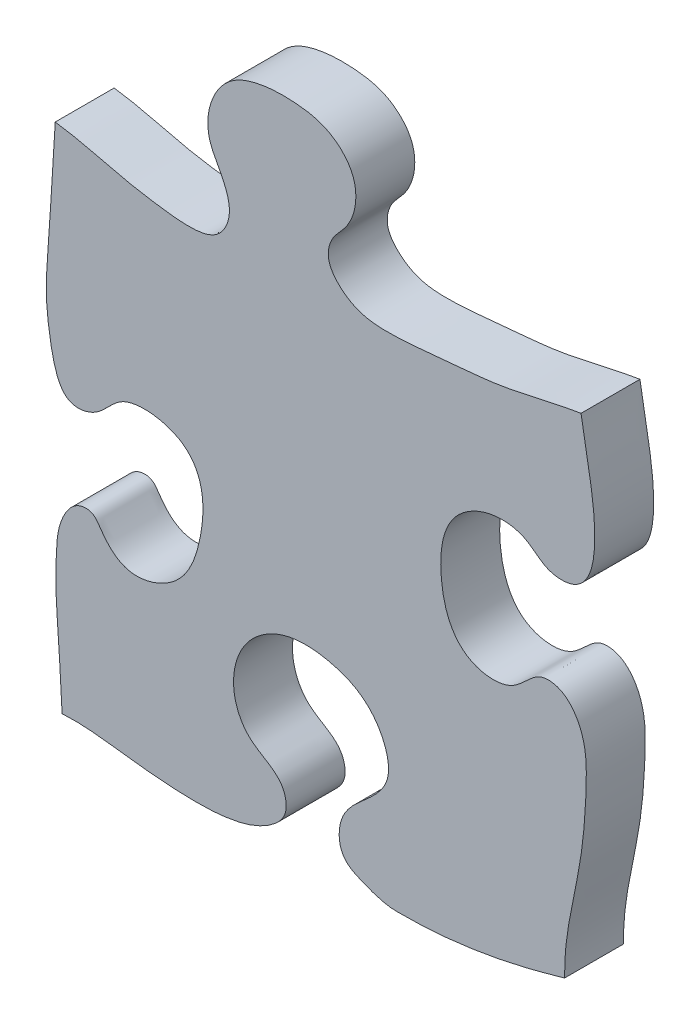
ISO-10303-21;
HEADER;
FILE_DESCRIPTION(('STEP AP214'),'2;1');
FILE_NAME('part.step','',(''),(''),'','','');
FILE_SCHEMA(('AUTOMOTIVE_DESIGN { 1 0 10303 214 1 1 1 1 }'));
ENDSEC;
DATA;
#1=APPLICATION_CONTEXT('core data for automotive mechanical design processes');
#2=APPLICATION_PROTOCOL_DEFINITION('international standard','automotive_design',2000,#1);
#3=PRODUCT_CONTEXT('',#1,'mechanical');
#4=PRODUCT('Part','Part','',(#3));
#5=PRODUCT_RELATED_PRODUCT_CATEGORY('part','',(#4));
#6=PRODUCT_DEFINITION_FORMATION('','',#4);
#7=PRODUCT_DEFINITION_CONTEXT('part definition',#1,'design');
#8=PRODUCT_DEFINITION('design','',#6,#7);
#9=PRODUCT_DEFINITION_SHAPE('','',#8);
#10=(LENGTH_UNIT() NAMED_UNIT(*) SI_UNIT(.MILLI.,.METRE.));
#11=(NAMED_UNIT(*) PLANE_ANGLE_UNIT() SI_UNIT($,.RADIAN.));
#12=(NAMED_UNIT(*) SI_UNIT($,.STERADIAN.) SOLID_ANGLE_UNIT());
#13=UNCERTAINTY_MEASURE_WITH_UNIT(LENGTH_MEASURE(1.E-05),#10,'distance_accuracy_value','');
#14=(GEOMETRIC_REPRESENTATION_CONTEXT(3) GLOBAL_UNCERTAINTY_ASSIGNED_CONTEXT((#13)) GLOBAL_UNIT_ASSIGNED_CONTEXT((#10,
#11,#12)) REPRESENTATION_CONTEXT('',''));
#15=CARTESIAN_POINT('',(0.,0.,0.));
#16=DIRECTION('',(0.,0.,1.));
#17=DIRECTION('',(1.,0.,0.));
#18=AXIS2_PLACEMENT_3D('',#15,#16,#17);
#19=CARTESIAN_POINT('',(-9.39078729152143,356.,-0.00999999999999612));
#20=CARTESIAN_POINT('',(-10.6420004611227,342.109118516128,-0.00999999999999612));
#21=CARTESIAN_POINT('',(-14.6613121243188,319.56927935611,-0.00999999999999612));
#22=CARTESIAN_POINT('',(-17.4473947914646,293.08555207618,-0.00999999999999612));
#23=CARTESIAN_POINT('',(-13.8884373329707,273.667988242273,-0.00999999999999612));
#24=CARTESIAN_POINT('',(-1.07625820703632,271.397705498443,-0.00999999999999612));
#25=CARTESIAN_POINT('',(5.29309239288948,278.450722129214,-0.00999999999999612));
#26=CARTESIAN_POINT('',(14.9258759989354,283.741247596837,-0.00999999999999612));
#27=CARTESIAN_POINT('',(28.790892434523,278.335723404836,-0.00999999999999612));
#28=CARTESIAN_POINT('',(34.7382562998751,261.206713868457,-0.00999999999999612));
#29=CARTESIAN_POINT('',(33.1132905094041,240.122633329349,-0.00999999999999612));
#30=CARTESIAN_POINT('',(14.6676977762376,229.968331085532,-0.00999999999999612));
#31=CARTESIAN_POINT('',(3.42611827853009,235.442407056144,-0.00999999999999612));
#32=CARTESIAN_POINT('',(-2.96249564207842,240.393740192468,-0.00999999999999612));
#33=CARTESIAN_POINT('',(-18.0780076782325,240.138784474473,-0.00999999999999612));
#34=CARTESIAN_POINT('',(-18.5399667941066,222.992463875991,-0.00999999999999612));
#35=CARTESIAN_POINT('',(-17.4385931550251,202.827665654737,-0.00999999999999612));
#36=CARTESIAN_POINT('',(-14.0858554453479,190.221137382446,-0.00999999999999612));
#37=CARTESIAN_POINT('',(-15.5193743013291,175.136568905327,-0.00999999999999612));
#38=CARTESIAN_POINT('',(-16.6888175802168,157.648124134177,-0.00999999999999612));
#39=CARTESIAN_POINT('',(-17.7707660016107,144.240131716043,-0.00999999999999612));
#40=CARTESIAN_POINT('',(-17.3940925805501,124.109890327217,-0.00999999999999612));
#41=CARTESIAN_POINT('',(-18.6861496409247,110.985540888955,-0.00999999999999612));
#42=CARTESIAN_POINT('',(-3.94695866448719,101.126063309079,-0.00999999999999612));
#43=CARTESIAN_POINT('',(4.50824278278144,111.148466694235,-0.00999999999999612));
#44=CARTESIAN_POINT('',(13.1578407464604,120.870763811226,-0.00999999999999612));
#45=CARTESIAN_POINT('',(29.968112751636,122.314288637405,-0.00999999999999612));
#46=CARTESIAN_POINT('',(40.7223803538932,110.783826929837,-0.00999999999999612));
#47=CARTESIAN_POINT('',(45.7909417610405,94.3968136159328,-0.00999999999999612));
#48=CARTESIAN_POINT('',(43.9390810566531,75.8787758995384,-0.00999999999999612));
#49=CARTESIAN_POINT('',(30.503103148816,62.5847389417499,-0.00999999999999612));
#50=CARTESIAN_POINT('',(14.6986660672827,64.8647821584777,-0.00999999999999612));
#51=CARTESIAN_POINT('',(6.48631275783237,74.2887035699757,-0.00999999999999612));
#52=CARTESIAN_POINT('',(-2.74495882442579,80.3019272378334,-0.00999999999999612));
#53=CARTESIAN_POINT('',(-19.8840521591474,73.8019115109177,-0.00999999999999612));
#54=CARTESIAN_POINT('',(-15.1166354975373,44.269693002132,-0.00999999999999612));
#55=CARTESIAN_POINT('',(-13.5094217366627,17.7920418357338,-0.00999999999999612));
#56=CARTESIAN_POINT('',(-10.2430798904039,-1.06342782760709,-0.00999999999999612));
#57=CARTESIAN_POINT('',(-6.15123504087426,-23.5391381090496,-0.00999999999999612));
#58=CARTESIAN_POINT('',(-4.12992604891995,-48.8436757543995,-0.00999999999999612));
#59=CARTESIAN_POINT('',(-23.2142462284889,-47.7574601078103,-0.00999999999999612));
#60=CARTESIAN_POINT('',(-30.0018234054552,-40.5423137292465,-0.00999999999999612));
#61=CARTESIAN_POINT('',(-42.7528213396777,-39.1853410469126,-0.00999999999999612));
#62=CARTESIAN_POINT('',(-57.5092962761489,-47.8418744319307,-0.00999999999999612));
#63=CARTESIAN_POINT('',(-60.2210733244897,-67.5138769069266,-0.00999999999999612));
#64=CARTESIAN_POINT('',(-54.0018378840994,-88.1567638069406,-0.00999999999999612));
#65=CARTESIAN_POINT('',(-33.5101255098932,-90.2818581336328,-0.00999999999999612));
#66=CARTESIAN_POINT('',(-26.938266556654,-78.8436195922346,-0.00999999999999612));
#67=CARTESIAN_POINT('',(-16.0575989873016,-79.9605650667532,-0.00999999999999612));
#68=CARTESIAN_POINT('',(-9.29054500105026,-89.9843542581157,-0.00999999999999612));
#69=CARTESIAN_POINT('',(-9.26037942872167,-106.547726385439,-0.00999999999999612));
#70=CARTESIAN_POINT('',(-10.8655976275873,-129.908253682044,-0.00999999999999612));
#71=CARTESIAN_POINT('',(-18.080355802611,-155.05589418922,-0.00999999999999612));
#72=CARTESIAN_POINT('',(-15.5015350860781,-180.564325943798,-0.00999999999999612));
#73=CARTESIAN_POINT('',(-13.4534563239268,-202.72625863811,-0.00999999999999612));
#74=CARTESIAN_POINT('',(-13.0721771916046,-222.761537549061,-0.00999999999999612));
#75=CARTESIAN_POINT('',(-18.0801009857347,-237.162246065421,-0.00999999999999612));
#76=CARTESIAN_POINT('',(-28.3640065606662,-243.264641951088,-0.00999999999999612));
#77=CARTESIAN_POINT('',(-35.3195309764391,-234.565632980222,-0.00999999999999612));
#78=CARTESIAN_POINT('',(-45.5220607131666,-230.442721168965,-0.00999999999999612));
#79=CARTESIAN_POINT('',(-58.2826152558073,-236.227844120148,-0.00999999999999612));
#80=CARTESIAN_POINT('',(-63.2505187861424,-252.690663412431,-0.00999999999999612));
#81=CARTESIAN_POINT('',(-62.4331763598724,-269.758175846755,-0.00999999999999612));
#82=CARTESIAN_POINT('',(-51.5712190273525,-281.475483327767,-0.00999999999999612));
#83=CARTESIAN_POINT('',(-36.6120763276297,-283.519302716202,-0.00999999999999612));
#84=CARTESIAN_POINT('',(-27.825780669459,-270.933950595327,-0.00999999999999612));
#85=CARTESIAN_POINT('',(-10.9923291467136,-277.705324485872,-0.00999999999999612));
#86=CARTESIAN_POINT('',(-14.9884890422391,-312.557066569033,-0.00999999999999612));
#87=CARTESIAN_POINT('',(-14.8626828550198,-333.640060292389,-0.00999999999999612));
#88=CARTESIAN_POINT('',(-17.0261941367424,-356.,-0.00999999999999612));
#89=B_SPLINE_CURVE_WITH_KNOTS('',3,(#19,#20,#21,#22,#23,#24,#25,#26,#27,#28,#29,#30,#31,#32,#33,
#34,#35,#36,#37,#38,#39,#40,#41,#42,#43,#44,#45,#46,#47,#48,#49,#50,#51,#52,#53,#54,#55,#56,#57,
#58,#59,#60,#61,#62,#63,#64,#65,#66,#67,#68,#69,#70,#71,#72,#73,#74,#75,#76,#77,#78,#79,#80,#81,
#82,#83,#84,#85,#86,#87,#88),.UNSPECIFIED.,.F.,.F.,(4,1,1,1,1,1,1,1,1,1,1,1,1,1,1,1,1,1,1,1,1,1,
1,1,1,1,1,1,1,1,1,1,1,1,1,1,1,1,1,1,1,1,1,1,1,1,1,1,1,1,1,1,1,1,1,1,1,1,1,1,1,1,1,1,1,1,1,4),
(0.,0.0382435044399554,0.06014267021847,0.0759154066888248,0.0830880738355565,
0.0898528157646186,0.100420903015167,0.110971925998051,0.125303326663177,0.146622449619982,
0.16313068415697,0.171984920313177,0.178976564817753,0.184846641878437,0.208558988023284,
0.213294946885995,0.232206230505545,0.247690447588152,0.25282597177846,0.280146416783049,
0.285652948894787,0.304476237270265,0.313783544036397,0.32377706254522,0.334253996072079,
0.350240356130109,0.361652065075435,0.37428972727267,0.396319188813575,0.408299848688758,
0.421251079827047,0.43387737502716,0.442611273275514,0.448402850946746,0.478919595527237,
0.50340807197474,0.525599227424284,0.531488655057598,0.562302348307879,0.569309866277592,
0.576593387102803,0.588291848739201,0.600948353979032,0.618957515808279,0.638096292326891,
0.652011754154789,0.663601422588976,0.667955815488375,0.679319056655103,0.692000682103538,
0.712742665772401,0.742765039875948,0.761777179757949,0.781638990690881,0.803327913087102,
0.815753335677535,0.82139602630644,0.831491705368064,0.840302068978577,0.85029925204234,
0.865053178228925,0.884091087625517,0.893653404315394,0.906570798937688,0.918850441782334,
0.928550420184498,0.945628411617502,1.),.UNSPECIFIED.);
#90=DIRECTION('',(0.,0.,1.));
#91=VECTOR('',#90,1.);
#92=SURFACE_OF_LINEAR_EXTRUSION('',#89,#91);
#93=CARTESIAN_POINT('',(-9.39078729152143,356.,20.));
#94=CARTESIAN_POINT('',(-10.6420004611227,342.109118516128,20.));
#95=CARTESIAN_POINT('',(-14.6613121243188,319.56927935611,20.));
#96=CARTESIAN_POINT('',(-17.4473947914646,293.08555207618,20.));
#97=CARTESIAN_POINT('',(-13.8884373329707,273.667988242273,20.));
#98=CARTESIAN_POINT('',(-1.07625820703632,271.397705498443,20.));
#99=CARTESIAN_POINT('',(5.29309239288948,278.450722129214,20.));
#100=CARTESIAN_POINT('',(14.9258759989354,283.741247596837,20.));
#101=CARTESIAN_POINT('',(28.790892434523,278.335723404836,20.));
#102=CARTESIAN_POINT('',(34.7382562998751,261.206713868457,20.));
#103=CARTESIAN_POINT('',(33.1132905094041,240.122633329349,20.));
#104=CARTESIAN_POINT('',(14.6676977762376,229.968331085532,20.));
#105=CARTESIAN_POINT('',(3.42611827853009,235.442407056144,20.));
#106=CARTESIAN_POINT('',(-2.96249564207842,240.393740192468,20.));
#107=CARTESIAN_POINT('',(-18.0780076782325,240.138784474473,20.));
#108=CARTESIAN_POINT('',(-18.5399667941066,222.992463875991,20.));
#109=CARTESIAN_POINT('',(-17.4385931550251,202.827665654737,20.));
#110=CARTESIAN_POINT('',(-14.0858554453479,190.221137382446,20.));
#111=CARTESIAN_POINT('',(-15.5193743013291,175.136568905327,20.));
#112=CARTESIAN_POINT('',(-16.6888175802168,157.648124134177,20.));
#113=CARTESIAN_POINT('',(-17.7707660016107,144.240131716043,20.));
#114=CARTESIAN_POINT('',(-17.3940925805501,124.109890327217,20.));
#115=CARTESIAN_POINT('',(-18.6861496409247,110.985540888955,20.));
#116=CARTESIAN_POINT('',(-3.94695866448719,101.126063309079,20.));
#117=CARTESIAN_POINT('',(4.50824278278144,111.148466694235,20.));
#118=CARTESIAN_POINT('',(13.1578407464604,120.870763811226,20.));
#119=CARTESIAN_POINT('',(29.968112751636,122.314288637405,20.));
#120=CARTESIAN_POINT('',(40.7223803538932,110.783826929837,20.));
#121=CARTESIAN_POINT('',(45.7909417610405,94.3968136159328,20.));
#122=CARTESIAN_POINT('',(43.9390810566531,75.8787758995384,20.));
#123=CARTESIAN_POINT('',(30.503103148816,62.5847389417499,20.));
#124=CARTESIAN_POINT('',(14.6986660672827,64.8647821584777,20.));
#125=CARTESIAN_POINT('',(6.48631275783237,74.2887035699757,20.));
#126=CARTESIAN_POINT('',(-2.74495882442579,80.3019272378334,20.));
#127=CARTESIAN_POINT('',(-19.8840521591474,73.8019115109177,20.));
#128=CARTESIAN_POINT('',(-15.1166354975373,44.269693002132,20.));
#129=CARTESIAN_POINT('',(-13.5094217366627,17.7920418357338,20.));
#130=CARTESIAN_POINT('',(-10.2430798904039,-1.06342782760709,20.));
#131=CARTESIAN_POINT('',(-6.15123504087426,-23.5391381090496,20.));
#132=CARTESIAN_POINT('',(-4.12992604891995,-48.8436757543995,20.));
#133=CARTESIAN_POINT('',(-23.2142462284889,-47.7574601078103,20.));
#134=CARTESIAN_POINT('',(-30.0018234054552,-40.5423137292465,20.));
#135=CARTESIAN_POINT('',(-42.7528213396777,-39.1853410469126,20.));
#136=CARTESIAN_POINT('',(-57.5092962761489,-47.8418744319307,20.));
#137=CARTESIAN_POINT('',(-60.2210733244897,-67.5138769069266,20.));
#138=CARTESIAN_POINT('',(-54.0018378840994,-88.1567638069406,20.));
#139=CARTESIAN_POINT('',(-33.5101255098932,-90.2818581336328,20.));
#140=CARTESIAN_POINT('',(-26.938266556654,-78.8436195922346,20.));
#141=CARTESIAN_POINT('',(-16.0575989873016,-79.9605650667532,20.));
#142=CARTESIAN_POINT('',(-9.29054500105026,-89.9843542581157,20.));
#143=CARTESIAN_POINT('',(-9.26037942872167,-106.547726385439,20.));
#144=CARTESIAN_POINT('',(-10.8655976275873,-129.908253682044,20.));
#145=CARTESIAN_POINT('',(-18.080355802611,-155.05589418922,20.));
#146=CARTESIAN_POINT('',(-15.5015350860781,-180.564325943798,20.));
#147=CARTESIAN_POINT('',(-13.4534563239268,-202.72625863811,20.));
#148=CARTESIAN_POINT('',(-13.0721771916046,-222.761537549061,20.));
#149=CARTESIAN_POINT('',(-18.0801009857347,-237.162246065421,20.));
#150=CARTESIAN_POINT('',(-28.3640065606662,-243.264641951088,20.));
#151=CARTESIAN_POINT('',(-35.3195309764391,-234.565632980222,20.));
#152=CARTESIAN_POINT('',(-45.5220607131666,-230.442721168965,20.));
#153=CARTESIAN_POINT('',(-58.2826152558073,-236.227844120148,20.));
#154=CARTESIAN_POINT('',(-63.2505187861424,-252.690663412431,20.));
#155=CARTESIAN_POINT('',(-62.4331763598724,-269.758175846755,20.));
#156=CARTESIAN_POINT('',(-51.5712190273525,-281.475483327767,20.));
#157=CARTESIAN_POINT('',(-36.6120763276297,-283.519302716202,20.));
#158=CARTESIAN_POINT('',(-27.825780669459,-270.933950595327,20.));
#159=CARTESIAN_POINT('',(-10.9923291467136,-277.705324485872,20.));
#160=CARTESIAN_POINT('',(-14.9884890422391,-312.557066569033,20.));
#161=CARTESIAN_POINT('',(-14.8626828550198,-333.640060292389,20.));
#162=CARTESIAN_POINT('',(-17.0261941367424,-356.,20.));
#163=B_SPLINE_CURVE_WITH_KNOTS('',3,(#93,#94,#95,#96,#97,#98,#99,#100,#101,#102,#103,#104,#105,
#106,#107,#108,#109,#110,#111,#112,#113,#114,#115,#116,#117,#118,#119,#120,#121,#122,#123,#124,
#125,#126,#127,#128,#129,#130,#131,#132,#133,#134,#135,#136,#137,#138,#139,#140,#141,#142,#143,
#144,#145,#146,#147,#148,#149,#150,#151,#152,#153,#154,#155,#156,#157,#158,#159,#160,#161,#162),
.UNSPECIFIED.,.F.,.F.,(4,1,1,1,1,1,1,1,1,1,1,1,1,1,1,1,1,1,1,1,1,1,1,1,1,1,1,1,1,1,1,1,1,1,1,1,
1,1,1,1,1,1,1,1,1,1,1,1,1,1,1,1,1,1,1,1,1,1,1,1,1,1,1,1,1,1,1,4),(0.,0.0382435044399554,
0.06014267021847,0.0759154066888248,0.0830880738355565,0.0898528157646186,0.100420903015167,
0.110971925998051,0.125303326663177,0.146622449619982,0.16313068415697,0.171984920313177,
0.178976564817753,0.184846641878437,0.208558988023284,0.213294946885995,0.232206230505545,
0.247690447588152,0.25282597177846,0.280146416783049,0.285652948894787,0.304476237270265,
0.313783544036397,0.32377706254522,0.334253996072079,0.350240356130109,0.361652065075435,
0.37428972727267,0.396319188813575,0.408299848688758,0.421251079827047,0.43387737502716,
0.442611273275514,0.448402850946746,0.478919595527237,0.50340807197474,0.525599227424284,
0.531488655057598,0.562302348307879,0.569309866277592,0.576593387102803,0.588291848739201,
0.600948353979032,0.618957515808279,0.638096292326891,0.652011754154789,0.663601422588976,
0.667955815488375,0.679319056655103,0.692000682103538,0.712742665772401,0.742765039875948,
0.761777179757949,0.781638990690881,0.803327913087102,0.815753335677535,0.82139602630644,
0.831491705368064,0.840302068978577,0.85029925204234,0.865053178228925,0.884091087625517,
0.893653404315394,0.906570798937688,0.918850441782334,0.928550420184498,0.945628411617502,1.),.UNSPECIFIED.);
#164=CARTESIAN_POINT('',(-11.1415971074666,4.42864181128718,20.));
#165=VERTEX_POINT('',#164);
#166=CARTESIAN_POINT('',(-16.6986782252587,-164.35007147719,20.));
#167=VERTEX_POINT('',#166);
#168=EDGE_CURVE('E90',#165,#167,#163,.T.);
#169=ORIENTED_EDGE('',*,*,#168,.T.);
#170=DIRECTION('',(0.,0.,1.));
#171=VECTOR('',#170,1.);
#172=CARTESIAN_POINT('',(-16.6986782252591,-164.350071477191,-0.00999999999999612));
#173=LINE('',#172,#171);
#174=CARTESIAN_POINT('',(-16.6986782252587,-164.35007147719,0.));
#175=VERTEX_POINT('',#174);
#176=EDGE_CURVE('E80',#167,#175,#173,.F.);
#177=ORIENTED_EDGE('',*,*,#176,.T.);
#178=CARTESIAN_POINT('',(-9.39078729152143,356.,0.));
#179=CARTESIAN_POINT('',(-10.6420004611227,342.109118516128,0.));
#180=CARTESIAN_POINT('',(-14.6613121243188,319.56927935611,0.));
#181=CARTESIAN_POINT('',(-17.4473947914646,293.08555207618,0.));
#182=CARTESIAN_POINT('',(-13.8884373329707,273.667988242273,0.));
#183=CARTESIAN_POINT('',(-1.07625820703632,271.397705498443,0.));
#184=CARTESIAN_POINT('',(5.29309239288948,278.450722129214,0.));
#185=CARTESIAN_POINT('',(14.9258759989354,283.741247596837,0.));
#186=CARTESIAN_POINT('',(28.790892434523,278.335723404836,0.));
#187=CARTESIAN_POINT('',(34.7382562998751,261.206713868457,0.));
#188=CARTESIAN_POINT('',(33.1132905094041,240.122633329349,0.));
#189=CARTESIAN_POINT('',(14.6676977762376,229.968331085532,0.));
#190=CARTESIAN_POINT('',(3.42611827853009,235.442407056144,0.));
#191=CARTESIAN_POINT('',(-2.96249564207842,240.393740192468,0.));
#192=CARTESIAN_POINT('',(-18.0780076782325,240.138784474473,0.));
#193=CARTESIAN_POINT('',(-18.5399667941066,222.992463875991,0.));
#194=CARTESIAN_POINT('',(-17.4385931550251,202.827665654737,0.));
#195=CARTESIAN_POINT('',(-14.0858554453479,190.221137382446,0.));
#196=CARTESIAN_POINT('',(-15.5193743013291,175.136568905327,0.));
#197=CARTESIAN_POINT('',(-16.6888175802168,157.648124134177,0.));
#198=CARTESIAN_POINT('',(-17.7707660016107,144.240131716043,0.));
#199=CARTESIAN_POINT('',(-17.3940925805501,124.109890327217,0.));
#200=CARTESIAN_POINT('',(-18.6861496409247,110.985540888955,0.));
#201=CARTESIAN_POINT('',(-3.94695866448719,101.126063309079,0.));
#202=CARTESIAN_POINT('',(4.50824278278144,111.148466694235,0.));
#203=CARTESIAN_POINT('',(13.1578407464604,120.870763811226,0.));
#204=CARTESIAN_POINT('',(29.968112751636,122.314288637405,0.));
#205=CARTESIAN_POINT('',(40.7223803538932,110.783826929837,0.));
#206=CARTESIAN_POINT('',(45.7909417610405,94.3968136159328,0.));
#207=CARTESIAN_POINT('',(43.9390810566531,75.8787758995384,0.));
#208=CARTESIAN_POINT('',(30.503103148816,62.5847389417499,0.));
#209=CARTESIAN_POINT('',(14.6986660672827,64.8647821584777,0.));
#210=CARTESIAN_POINT('',(6.48631275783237,74.2887035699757,0.));
#211=CARTESIAN_POINT('',(-2.74495882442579,80.3019272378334,0.));
#212=CARTESIAN_POINT('',(-19.8840521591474,73.8019115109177,0.));
#213=CARTESIAN_POINT('',(-15.1166354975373,44.269693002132,0.));
#214=CARTESIAN_POINT('',(-13.5094217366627,17.7920418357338,0.));
#215=CARTESIAN_POINT('',(-10.2430798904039,-1.06342782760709,0.));
#216=CARTESIAN_POINT('',(-6.15123504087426,-23.5391381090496,0.));
#217=CARTESIAN_POINT('',(-4.12992604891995,-48.8436757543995,0.));
#218=CARTESIAN_POINT('',(-23.2142462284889,-47.7574601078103,0.));
#219=CARTESIAN_POINT('',(-30.0018234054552,-40.5423137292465,0.));
#220=CARTESIAN_POINT('',(-42.7528213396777,-39.1853410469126,0.));
#221=CARTESIAN_POINT('',(-57.5092962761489,-47.8418744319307,0.));
#222=CARTESIAN_POINT('',(-60.2210733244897,-67.5138769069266,0.));
#223=CARTESIAN_POINT('',(-54.0018378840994,-88.1567638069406,0.));
#224=CARTESIAN_POINT('',(-33.5101255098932,-90.2818581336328,0.));
#225=CARTESIAN_POINT('',(-26.938266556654,-78.8436195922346,0.));
#226=CARTESIAN_POINT('',(-16.0575989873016,-79.9605650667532,0.));
#227=CARTESIAN_POINT('',(-9.29054500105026,-89.9843542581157,0.));
#228=CARTESIAN_POINT('',(-9.26037942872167,-106.547726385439,0.));
#229=CARTESIAN_POINT('',(-10.8655976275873,-129.908253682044,0.));
#230=CARTESIAN_POINT('',(-18.080355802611,-155.05589418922,0.));
#231=CARTESIAN_POINT('',(-15.5015350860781,-180.564325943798,0.));
#232=CARTESIAN_POINT('',(-13.4534563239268,-202.72625863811,0.));
#233=CARTESIAN_POINT('',(-13.0721771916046,-222.761537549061,0.));
#234=CARTESIAN_POINT('',(-18.0801009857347,-237.162246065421,0.));
#235=CARTESIAN_POINT('',(-28.3640065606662,-243.264641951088,0.));
#236=CARTESIAN_POINT('',(-35.3195309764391,-234.565632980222,0.));
#237=CARTESIAN_POINT('',(-45.5220607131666,-230.442721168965,0.));
#238=CARTESIAN_POINT('',(-58.2826152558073,-236.227844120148,0.));
#239=CARTESIAN_POINT('',(-63.2505187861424,-252.690663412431,0.));
#240=CARTESIAN_POINT('',(-62.4331763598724,-269.758175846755,0.));
#241=CARTESIAN_POINT('',(-51.5712190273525,-281.475483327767,0.));
#242=CARTESIAN_POINT('',(-36.6120763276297,-283.519302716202,0.));
#243=CARTESIAN_POINT('',(-27.825780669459,-270.933950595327,0.));
#244=CARTESIAN_POINT('',(-10.9923291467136,-277.705324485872,0.));
#245=CARTESIAN_POINT('',(-14.9884890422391,-312.557066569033,0.));
#246=CARTESIAN_POINT('',(-14.8626828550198,-333.640060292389,0.));
#247=CARTESIAN_POINT('',(-17.0261941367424,-356.,0.));
#248=B_SPLINE_CURVE_WITH_KNOTS('',3,(#178,#179,#180,#181,#182,#183,#184,#185,#186,#187,#188,
#189,#190,#191,#192,#193,#194,#195,#196,#197,#198,#199,#200,#201,#202,#203,#204,#205,#206,#207,
#208,#209,#210,#211,#212,#213,#214,#215,#216,#217,#218,#219,#220,#221,#222,#223,#224,#225,#226,
#227,#228,#229,#230,#231,#232,#233,#234,#235,#236,#237,#238,#239,#240,#241,#242,#243,#244,#245,
#246,#247),.UNSPECIFIED.,.F.,.F.,(4,1,1,1,1,1,1,1,1,1,1,1,1,1,1,1,1,1,1,1,1,1,1,1,1,1,1,1,1,1,1,
1,1,1,1,1,1,1,1,1,1,1,1,1,1,1,1,1,1,1,1,1,1,1,1,1,1,1,1,1,1,1,1,1,1,1,1,4),(0.,
0.0382435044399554,0.06014267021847,0.0759154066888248,0.0830880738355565,0.0898528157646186,
0.100420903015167,0.110971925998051,0.125303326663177,0.146622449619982,0.16313068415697,
0.171984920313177,0.178976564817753,0.184846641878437,0.208558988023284,0.213294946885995,
0.232206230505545,0.247690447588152,0.25282597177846,0.280146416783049,0.285652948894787,
0.304476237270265,0.313783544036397,0.32377706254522,0.334253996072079,0.350240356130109,
0.361652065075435,0.37428972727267,0.396319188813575,0.408299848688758,0.421251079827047,
0.43387737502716,0.442611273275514,0.448402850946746,0.478919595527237,0.50340807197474,
0.525599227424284,0.531488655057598,0.562302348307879,0.569309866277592,0.576593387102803,
0.588291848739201,0.600948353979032,0.618957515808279,0.638096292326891,0.652011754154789,
0.663601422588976,0.667955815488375,0.679319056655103,0.692000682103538,0.712742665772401,
0.742765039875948,0.761777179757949,0.781638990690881,0.803327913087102,0.815753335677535,
0.82139602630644,0.831491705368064,0.840302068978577,0.85029925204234,0.865053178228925,
0.884091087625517,0.893653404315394,0.906570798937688,0.918850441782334,0.928550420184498,
0.945628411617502,1.),.UNSPECIFIED.);
#249=CARTESIAN_POINT('',(-11.1415971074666,4.42864181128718,0.));
#250=VERTEX_POINT('',#249);
#251=EDGE_CURVE('E122',#250,#175,#248,.T.);
#252=ORIENTED_EDGE('',*,*,#251,.F.);
#253=DIRECTION('',(0.,0.,1.));
#254=VECTOR('',#253,1.);
#255=CARTESIAN_POINT('',(-11.1415971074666,4.42864181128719,-0.00999999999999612));
#256=LINE('',#255,#254);
#257=EDGE_CURVE('E91',#165,#250,#256,.F.);
#258=ORIENTED_EDGE('',*,*,#257,.F.);
#259=EDGE_LOOP('',(#169,#177,#252,#258));
#260=FACE_BOUND('',#259,.T.);
#261=ADVANCED_FACE('F34',(#260),#92,.F.);
#262=CARTESIAN_POINT('',(-186.393246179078,356.,-0.00999999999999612));
#263=CARTESIAN_POINT('',(-186.465644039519,346.788250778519,-0.00999999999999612));
#264=CARTESIAN_POINT('',(-188.628884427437,329.478394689,-0.00999999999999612));
#265=CARTESIAN_POINT('',(-190.429976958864,304.816732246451,-0.00999999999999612));
#266=CARTESIAN_POINT('',(-187.884620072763,287.022607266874,-0.00999999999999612));
#267=CARTESIAN_POINT('',(-177.83183487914,273.701157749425,-0.00999999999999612));
#268=CARTESIAN_POINT('',(-167.372440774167,281.069990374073,-0.00999999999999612));
#269=CARTESIAN_POINT('',(-162.424812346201,293.671302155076,-0.00999999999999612));
#270=CARTESIAN_POINT('',(-138.980403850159,295.954762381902,-0.00999999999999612));
#271=CARTESIAN_POINT('',(-129.023505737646,274.502332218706,-0.00999999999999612));
#272=CARTESIAN_POINT('',(-130.151753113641,256.130310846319,-0.00999999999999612));
#273=CARTESIAN_POINT('',(-138.180313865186,240.882815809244,-0.00999999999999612));
#274=CARTESIAN_POINT('',(-153.903325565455,237.974697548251,-0.00999999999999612));
#275=CARTESIAN_POINT('',(-162.781582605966,247.270783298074,-0.00999999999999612));
#276=CARTESIAN_POINT('',(-171.61954140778,254.983724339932,-0.00999999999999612));
#277=CARTESIAN_POINT('',(-186.267660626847,251.663377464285,-0.00999999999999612));
#278=CARTESIAN_POINT('',(-188.178219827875,226.271427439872,-0.00999999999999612));
#279=CARTESIAN_POINT('',(-186.828985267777,214.10322906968,-0.00999999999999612));
#280=CARTESIAN_POINT('',(-182.631402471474,181.666904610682,-0.00999999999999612));
#281=CARTESIAN_POINT('',(-187.119801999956,157.75465666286,-0.00999999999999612));
#282=CARTESIAN_POINT('',(-187.457937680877,142.904539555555,-0.00999999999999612));
#283=CARTESIAN_POINT('',(-184.089404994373,126.204275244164,-0.00999999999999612));
#284=CARTESIAN_POINT('',(-168.499206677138,126.488047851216,-0.00999999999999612));
#285=CARTESIAN_POINT('',(-158.423592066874,136.759079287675,-0.00999999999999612));
#286=CARTESIAN_POINT('',(-133.598254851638,130.460350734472,-0.00999999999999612));
#287=CARTESIAN_POINT('',(-132.174041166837,109.25711139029,-0.00999999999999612));
#288=CARTESIAN_POINT('',(-137.401430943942,84.0677449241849,-0.00999999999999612));
#289=CARTESIAN_POINT('',(-159.905312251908,82.8448138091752,-0.00999999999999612));
#290=CARTESIAN_POINT('',(-167.594499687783,95.2630828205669,-0.00999999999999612));
#291=CARTESIAN_POINT('',(-184.064608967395,90.371493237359,-0.00999999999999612));
#292=CARTESIAN_POINT('',(-186.999172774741,63.1173196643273,-0.00999999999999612));
#293=CARTESIAN_POINT('',(-188.17555036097,34.3474510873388,-0.00999999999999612));
#294=CARTESIAN_POINT('',(-189.520016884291,-1.94344937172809,-0.00999999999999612));
#295=CARTESIAN_POINT('',(-192.230906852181,-38.9111914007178,-0.00999999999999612));
#296=CARTESIAN_POINT('',(-193.196462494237,-56.4819013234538,-0.00999999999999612));
#297=CARTESIAN_POINT('',(-187.787083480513,-81.0819408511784,-0.00999999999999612));
#298=CARTESIAN_POINT('',(-174.027975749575,-78.613025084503,-0.00999999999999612));
#299=CARTESIAN_POINT('',(-167.64120428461,-66.7586676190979,-0.00999999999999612));
#300=CARTESIAN_POINT('',(-138.878579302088,-69.8200733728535,-0.00999999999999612));
#301=CARTESIAN_POINT('',(-138.315063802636,-94.39593724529,-0.00999999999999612));
#302=CARTESIAN_POINT('',(-145.951566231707,-114.49908529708,-0.00999999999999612));
#303=CARTESIAN_POINT('',(-163.555921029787,-121.175747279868,-0.00999999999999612));
#304=CARTESIAN_POINT('',(-172.11578880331,-114.919909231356,-0.00999999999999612));
#305=CARTESIAN_POINT('',(-176.485425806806,-107.364168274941,-0.00999999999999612));
#306=CARTESIAN_POINT('',(-184.309097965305,-107.607264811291,-0.00999999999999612));
#307=CARTESIAN_POINT('',(-188.561946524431,-116.100575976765,-0.00999999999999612));
#308=CARTESIAN_POINT('',(-189.834439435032,-132.751458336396,-0.00999999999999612));
#309=CARTESIAN_POINT('',(-188.899668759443,-143.69775261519,-0.00999999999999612));
#310=CARTESIAN_POINT('',(-186.87437190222,-176.639875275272,-0.00999999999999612));
#311=CARTESIAN_POINT('',(-187.115886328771,-188.95785352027,-0.00999999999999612));
#312=CARTESIAN_POINT('',(-184.068917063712,-208.490912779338,-0.00999999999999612));
#313=CARTESIAN_POINT('',(-184.462371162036,-228.434350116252,-0.00999999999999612));
#314=CARTESIAN_POINT('',(-182.717405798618,-241.744671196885,-0.00999999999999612));
#315=CARTESIAN_POINT('',(-190.107123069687,-258.646375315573,-0.00999999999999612));
#316=CARTESIAN_POINT('',(-204.50360377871,-253.849993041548,-0.00999999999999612));
#317=CARTESIAN_POINT('',(-211.768269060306,-241.698033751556,-0.00999999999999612));
#318=CARTESIAN_POINT('',(-230.141572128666,-243.165284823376,-0.00999999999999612));
#319=CARTESIAN_POINT('',(-238.864067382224,-259.702852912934,-0.00999999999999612));
#320=CARTESIAN_POINT('',(-237.82033634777,-276.944530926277,-0.00999999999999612));
#321=CARTESIAN_POINT('',(-229.688332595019,-293.402921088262,-0.00999999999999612));
#322=CARTESIAN_POINT('',(-210.804716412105,-298.51720908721,-0.00999999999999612));
#323=CARTESIAN_POINT('',(-204.725260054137,-287.600226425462,-0.00999999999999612));
#324=CARTESIAN_POINT('',(-198.130842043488,-278.388409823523,-0.00999999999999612));
#325=CARTESIAN_POINT('',(-189.724281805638,-288.428094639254,-0.00999999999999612));
#326=CARTESIAN_POINT('',(-185.110914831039,-304.121783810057,-0.00999999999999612));
#327=CARTESIAN_POINT('',(-188.504639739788,-328.326605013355,-0.00999999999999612));
#328=CARTESIAN_POINT('',(-188.031330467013,-347.655914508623,-0.00999999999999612));
#329=CARTESIAN_POINT('',(-188.197680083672,-356.,-0.00999999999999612));
#330=B_SPLINE_CURVE_WITH_KNOTS('',3,(#262,#263,#264,#265,#266,#267,#268,#269,#270,#271,#272,
#273,#274,#275,#276,#277,#278,#279,#280,#281,#282,#283,#284,#285,#286,#287,#288,#289,#290,#291,
#292,#293,#294,#295,#296,#297,#298,#299,#300,#301,#302,#303,#304,#305,#306,#307,#308,#309,#310,
#311,#312,#313,#314,#315,#316,#317,#318,#319,#320,#321,#322,#323,#324,#325,#326,#327,#328,#329),
.UNSPECIFIED.,.F.,.F.,(4,1,1,1,1,1,1,1,1,1,1,1,1,1,1,1,1,1,1,1,1,1,1,1,1,1,1,1,1,1,1,1,1,1,1,1,
1,1,1,1,1,1,1,1,1,1,1,1,1,1,1,1,1,1,1,1,1,1,1,1,1,1,1,1,1,4),(0.,0.0262331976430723,
0.050560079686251,0.0695219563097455,0.0800713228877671,0.0885051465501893,0.099482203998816,
0.118619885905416,0.138837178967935,0.157899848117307,0.171291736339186,0.185151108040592,
0.19559453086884,0.206745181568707,0.217337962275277,0.230877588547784,0.26409725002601,
0.28835141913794,0.305292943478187,0.32505690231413,0.334743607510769,0.348191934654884,
0.358741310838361,0.375812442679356,0.401272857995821,0.416827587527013,0.432882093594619,
0.444490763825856,0.458014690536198,0.481063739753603,0.510647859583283,0.548186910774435,
0.587648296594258,0.610908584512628,0.621783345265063,0.631931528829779,0.643591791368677,
0.658807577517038,0.686126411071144,0.703957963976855,0.718649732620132,0.731300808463,
0.735266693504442,0.736591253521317,0.743662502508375,0.746501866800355,0.76410099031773,
0.785041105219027,0.790214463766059,0.812987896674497,0.817887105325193,0.836359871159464,
0.84408330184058,0.853053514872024,0.86313504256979,0.875355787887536,0.885829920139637,
0.902341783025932,0.912788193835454,0.926625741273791,0.934943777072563,0.940543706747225,
0.946912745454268,0.957064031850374,0.980148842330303,1.),.UNSPECIFIED.);
#331=DIRECTION('',(0.,0.,1.));
#332=VECTOR('',#331,1.);
#333=SURFACE_OF_LINEAR_EXTRUSION('',#330,#332);
#334=CARTESIAN_POINT('',(-186.393246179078,356.,20.));
#335=CARTESIAN_POINT('',(-186.465644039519,346.788250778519,20.));
#336=CARTESIAN_POINT('',(-188.628884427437,329.478394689,20.));
#337=CARTESIAN_POINT('',(-190.429976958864,304.816732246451,20.));
#338=CARTESIAN_POINT('',(-187.884620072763,287.022607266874,20.));
#339=CARTESIAN_POINT('',(-177.83183487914,273.701157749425,20.));
#340=CARTESIAN_POINT('',(-167.372440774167,281.069990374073,20.));
#341=CARTESIAN_POINT('',(-162.424812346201,293.671302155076,20.));
#342=CARTESIAN_POINT('',(-138.980403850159,295.954762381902,20.));
#343=CARTESIAN_POINT('',(-129.023505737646,274.502332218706,20.));
#344=CARTESIAN_POINT('',(-130.151753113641,256.130310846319,20.));
#345=CARTESIAN_POINT('',(-138.180313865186,240.882815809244,20.));
#346=CARTESIAN_POINT('',(-153.903325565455,237.974697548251,20.));
#347=CARTESIAN_POINT('',(-162.781582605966,247.270783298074,20.));
#348=CARTESIAN_POINT('',(-171.61954140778,254.983724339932,20.));
#349=CARTESIAN_POINT('',(-186.267660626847,251.663377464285,20.));
#350=CARTESIAN_POINT('',(-188.178219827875,226.271427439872,20.));
#351=CARTESIAN_POINT('',(-186.828985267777,214.10322906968,20.));
#352=CARTESIAN_POINT('',(-182.631402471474,181.666904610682,20.));
#353=CARTESIAN_POINT('',(-187.119801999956,157.75465666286,20.));
#354=CARTESIAN_POINT('',(-187.457937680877,142.904539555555,20.));
#355=CARTESIAN_POINT('',(-184.089404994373,126.204275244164,20.));
#356=CARTESIAN_POINT('',(-168.499206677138,126.488047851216,20.));
#357=CARTESIAN_POINT('',(-158.423592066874,136.759079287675,20.));
#358=CARTESIAN_POINT('',(-133.598254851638,130.460350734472,20.));
#359=CARTESIAN_POINT('',(-132.174041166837,109.25711139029,20.));
#360=CARTESIAN_POINT('',(-137.401430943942,84.0677449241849,20.));
#361=CARTESIAN_POINT('',(-159.905312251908,82.8448138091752,20.));
#362=CARTESIAN_POINT('',(-167.594499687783,95.2630828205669,20.));
#363=CARTESIAN_POINT('',(-184.064608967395,90.371493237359,20.));
#364=CARTESIAN_POINT('',(-186.999172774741,63.1173196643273,20.));
#365=CARTESIAN_POINT('',(-188.17555036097,34.3474510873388,20.));
#366=CARTESIAN_POINT('',(-189.520016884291,-1.94344937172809,20.));
#367=CARTESIAN_POINT('',(-192.230906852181,-38.9111914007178,20.));
#368=CARTESIAN_POINT('',(-193.196462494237,-56.4819013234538,20.));
#369=CARTESIAN_POINT('',(-187.787083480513,-81.0819408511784,20.));
#370=CARTESIAN_POINT('',(-174.027975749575,-78.613025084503,20.));
#371=CARTESIAN_POINT('',(-167.64120428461,-66.7586676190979,20.));
#372=CARTESIAN_POINT('',(-138.878579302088,-69.8200733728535,20.));
#373=CARTESIAN_POINT('',(-138.315063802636,-94.39593724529,20.));
#374=CARTESIAN_POINT('',(-145.951566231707,-114.49908529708,20.));
#375=CARTESIAN_POINT('',(-163.555921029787,-121.175747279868,20.));
#376=CARTESIAN_POINT('',(-172.11578880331,-114.919909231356,20.));
#377=CARTESIAN_POINT('',(-176.485425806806,-107.364168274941,20.));
#378=CARTESIAN_POINT('',(-184.309097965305,-107.607264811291,20.));
#379=CARTESIAN_POINT('',(-188.561946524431,-116.100575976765,20.));
#380=CARTESIAN_POINT('',(-189.834439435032,-132.751458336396,20.));
#381=CARTESIAN_POINT('',(-188.899668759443,-143.69775261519,20.));
#382=CARTESIAN_POINT('',(-186.87437190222,-176.639875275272,20.));
#383=CARTESIAN_POINT('',(-187.115886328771,-188.95785352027,20.));
#384=CARTESIAN_POINT('',(-184.068917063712,-208.490912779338,20.));
#385=CARTESIAN_POINT('',(-184.462371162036,-228.434350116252,20.));
#386=CARTESIAN_POINT('',(-182.717405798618,-241.744671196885,20.));
#387=CARTESIAN_POINT('',(-190.107123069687,-258.646375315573,20.));
#388=CARTESIAN_POINT('',(-204.50360377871,-253.849993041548,20.));
#389=CARTESIAN_POINT('',(-211.768269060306,-241.698033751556,20.));
#390=CARTESIAN_POINT('',(-230.141572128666,-243.165284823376,20.));
#391=CARTESIAN_POINT('',(-238.864067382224,-259.702852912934,20.));
#392=CARTESIAN_POINT('',(-237.82033634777,-276.944530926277,20.));
#393=CARTESIAN_POINT('',(-229.688332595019,-293.402921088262,20.));
#394=CARTESIAN_POINT('',(-210.804716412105,-298.51720908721,20.));
#395=CARTESIAN_POINT('',(-204.725260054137,-287.600226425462,20.));
#396=CARTESIAN_POINT('',(-198.130842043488,-278.388409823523,20.));
#397=CARTESIAN_POINT('',(-189.724281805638,-288.428094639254,20.));
#398=CARTESIAN_POINT('',(-185.110914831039,-304.121783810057,20.));
#399=CARTESIAN_POINT('',(-188.504639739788,-328.326605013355,20.));
#400=CARTESIAN_POINT('',(-188.031330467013,-347.655914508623,20.));
#401=CARTESIAN_POINT('',(-188.197680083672,-356.,20.));
#402=B_SPLINE_CURVE_WITH_KNOTS('',3,(#334,#335,#336,#337,#338,#339,#340,#341,#342,#343,#344,
#345,#346,#347,#348,#349,#350,#351,#352,#353,#354,#355,#356,#357,#358,#359,#360,#361,#362,#363,
#364,#365,#366,#367,#368,#369,#370,#371,#372,#373,#374,#375,#376,#377,#378,#379,#380,#381,#382,
#383,#384,#385,#386,#387,#388,#389,#390,#391,#392,#393,#394,#395,#396,#397,#398,#399,#400,#401),
.UNSPECIFIED.,.F.,.F.,(4,1,1,1,1,1,1,1,1,1,1,1,1,1,1,1,1,1,1,1,1,1,1,1,1,1,1,1,1,1,1,1,1,1,1,1,
1,1,1,1,1,1,1,1,1,1,1,1,1,1,1,1,1,1,1,1,1,1,1,1,1,1,1,1,1,4),(0.,0.0262331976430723,
0.050560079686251,0.0695219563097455,0.0800713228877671,0.0885051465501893,0.099482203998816,
0.118619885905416,0.138837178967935,0.157899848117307,0.171291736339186,0.185151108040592,
0.19559453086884,0.206745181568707,0.217337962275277,0.230877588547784,0.26409725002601,
0.28835141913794,0.305292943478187,0.32505690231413,0.334743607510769,0.348191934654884,
0.358741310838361,0.375812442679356,0.401272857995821,0.416827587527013,0.432882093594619,
0.444490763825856,0.458014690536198,0.481063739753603,0.510647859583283,0.548186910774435,
0.587648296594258,0.610908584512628,0.621783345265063,0.631931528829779,0.643591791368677,
0.658807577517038,0.686126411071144,0.703957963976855,0.718649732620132,0.731300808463,
0.735266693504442,0.736591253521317,0.743662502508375,0.746501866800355,0.76410099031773,
0.785041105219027,0.790214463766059,0.812987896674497,0.817887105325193,0.836359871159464,
0.84408330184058,0.853053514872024,0.86313504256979,0.875355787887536,0.885829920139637,
0.902341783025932,0.912788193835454,0.926625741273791,0.934943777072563,0.940543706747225,
0.946912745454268,0.957064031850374,0.980148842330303,1.),.UNSPECIFIED.);
#403=CARTESIAN_POINT('',(-189.617340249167,0.816183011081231,20.));
#404=VERTEX_POINT('',#403);
#405=CARTESIAN_POINT('',(-187.287524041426,-171.956059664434,20.));
#406=VERTEX_POINT('',#405);
#407=EDGE_CURVE('E53',#404,#406,#402,.T.);
#408=ORIENTED_EDGE('',*,*,#407,.F.);
#409=DIRECTION('',(0.,0.,1.));
#410=VECTOR('',#409,1.);
#411=CARTESIAN_POINT('',(-189.617340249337,0.816183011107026,-0.00999999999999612));
#412=LINE('',#411,#410);
#413=CARTESIAN_POINT('',(-189.617340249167,0.816183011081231,0.));
#414=VERTEX_POINT('',#413);
#415=EDGE_CURVE('E87',#404,#414,#412,.F.);
#416=ORIENTED_EDGE('',*,*,#415,.T.);
#417=CARTESIAN_POINT('',(-186.393246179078,356.,0.));
#418=CARTESIAN_POINT('',(-186.465644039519,346.788250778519,0.));
#419=CARTESIAN_POINT('',(-188.628884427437,329.478394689,0.));
#420=CARTESIAN_POINT('',(-190.429976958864,304.816732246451,0.));
#421=CARTESIAN_POINT('',(-187.884620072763,287.022607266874,0.));
#422=CARTESIAN_POINT('',(-177.83183487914,273.701157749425,0.));
#423=CARTESIAN_POINT('',(-167.372440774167,281.069990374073,0.));
#424=CARTESIAN_POINT('',(-162.424812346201,293.671302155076,0.));
#425=CARTESIAN_POINT('',(-138.980403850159,295.954762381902,0.));
#426=CARTESIAN_POINT('',(-129.023505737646,274.502332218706,0.));
#427=CARTESIAN_POINT('',(-130.151753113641,256.130310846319,0.));
#428=CARTESIAN_POINT('',(-138.180313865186,240.882815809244,0.));
#429=CARTESIAN_POINT('',(-153.903325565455,237.974697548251,0.));
#430=CARTESIAN_POINT('',(-162.781582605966,247.270783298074,0.));
#431=CARTESIAN_POINT('',(-171.61954140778,254.983724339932,0.));
#432=CARTESIAN_POINT('',(-186.267660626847,251.663377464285,0.));
#433=CARTESIAN_POINT('',(-188.178219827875,226.271427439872,0.));
#434=CARTESIAN_POINT('',(-186.828985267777,214.10322906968,0.));
#435=CARTESIAN_POINT('',(-182.631402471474,181.666904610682,0.));
#436=CARTESIAN_POINT('',(-187.119801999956,157.75465666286,0.));
#437=CARTESIAN_POINT('',(-187.457937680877,142.904539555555,0.));
#438=CARTESIAN_POINT('',(-184.089404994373,126.204275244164,0.));
#439=CARTESIAN_POINT('',(-168.499206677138,126.488047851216,0.));
#440=CARTESIAN_POINT('',(-158.423592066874,136.759079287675,0.));
#441=CARTESIAN_POINT('',(-133.598254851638,130.460350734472,0.));
#442=CARTESIAN_POINT('',(-132.174041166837,109.25711139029,0.));
#443=CARTESIAN_POINT('',(-137.401430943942,84.0677449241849,0.));
#444=CARTESIAN_POINT('',(-159.905312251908,82.8448138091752,0.));
#445=CARTESIAN_POINT('',(-167.594499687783,95.2630828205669,0.));
#446=CARTESIAN_POINT('',(-184.064608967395,90.371493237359,0.));
#447=CARTESIAN_POINT('',(-186.999172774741,63.1173196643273,0.));
#448=CARTESIAN_POINT('',(-188.17555036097,34.3474510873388,0.));
#449=CARTESIAN_POINT('',(-189.520016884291,-1.94344937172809,0.));
#450=CARTESIAN_POINT('',(-192.230906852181,-38.9111914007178,0.));
#451=CARTESIAN_POINT('',(-193.196462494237,-56.4819013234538,0.));
#452=CARTESIAN_POINT('',(-187.787083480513,-81.0819408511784,0.));
#453=CARTESIAN_POINT('',(-174.027975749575,-78.613025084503,0.));
#454=CARTESIAN_POINT('',(-167.64120428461,-66.7586676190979,0.));
#455=CARTESIAN_POINT('',(-138.878579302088,-69.8200733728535,0.));
#456=CARTESIAN_POINT('',(-138.315063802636,-94.39593724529,0.));
#457=CARTESIAN_POINT('',(-145.951566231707,-114.49908529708,0.));
#458=CARTESIAN_POINT('',(-163.555921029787,-121.175747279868,0.));
#459=CARTESIAN_POINT('',(-172.11578880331,-114.919909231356,0.));
#460=CARTESIAN_POINT('',(-176.485425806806,-107.364168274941,0.));
#461=CARTESIAN_POINT('',(-184.309097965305,-107.607264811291,0.));
#462=CARTESIAN_POINT('',(-188.561946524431,-116.100575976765,0.));
#463=CARTESIAN_POINT('',(-189.834439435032,-132.751458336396,0.));
#464=CARTESIAN_POINT('',(-188.899668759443,-143.69775261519,0.));
#465=CARTESIAN_POINT('',(-186.87437190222,-176.639875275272,0.));
#466=CARTESIAN_POINT('',(-187.115886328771,-188.95785352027,0.));
#467=CARTESIAN_POINT('',(-184.068917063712,-208.490912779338,0.));
#468=CARTESIAN_POINT('',(-184.462371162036,-228.434350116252,0.));
#469=CARTESIAN_POINT('',(-182.717405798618,-241.744671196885,0.));
#470=CARTESIAN_POINT('',(-190.107123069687,-258.646375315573,0.));
#471=CARTESIAN_POINT('',(-204.50360377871,-253.849993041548,0.));
#472=CARTESIAN_POINT('',(-211.768269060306,-241.698033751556,0.));
#473=CARTESIAN_POINT('',(-230.141572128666,-243.165284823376,0.));
#474=CARTESIAN_POINT('',(-238.864067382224,-259.702852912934,0.));
#475=CARTESIAN_POINT('',(-237.82033634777,-276.944530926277,0.));
#476=CARTESIAN_POINT('',(-229.688332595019,-293.402921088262,0.));
#477=CARTESIAN_POINT('',(-210.804716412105,-298.51720908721,0.));
#478=CARTESIAN_POINT('',(-204.725260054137,-287.600226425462,0.));
#479=CARTESIAN_POINT('',(-198.130842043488,-278.388409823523,0.));
#480=CARTESIAN_POINT('',(-189.724281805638,-288.428094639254,0.));
#481=CARTESIAN_POINT('',(-185.110914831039,-304.121783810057,0.));
#482=CARTESIAN_POINT('',(-188.504639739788,-328.326605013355,0.));
#483=CARTESIAN_POINT('',(-188.031330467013,-347.655914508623,0.));
#484=CARTESIAN_POINT('',(-188.197680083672,-356.,0.));
#485=B_SPLINE_CURVE_WITH_KNOTS('',3,(#417,#418,#419,#420,#421,#422,#423,#424,#425,#426,#427,
#428,#429,#430,#431,#432,#433,#434,#435,#436,#437,#438,#439,#440,#441,#442,#443,#444,#445,#446,
#447,#448,#449,#450,#451,#452,#453,#454,#455,#456,#457,#458,#459,#460,#461,#462,#463,#464,#465,
#466,#467,#468,#469,#470,#471,#472,#473,#474,#475,#476,#477,#478,#479,#480,#481,#482,#483,#484),
.UNSPECIFIED.,.F.,.F.,(4,1,1,1,1,1,1,1,1,1,1,1,1,1,1,1,1,1,1,1,1,1,1,1,1,1,1,1,1,1,1,1,1,1,1,1,
1,1,1,1,1,1,1,1,1,1,1,1,1,1,1,1,1,1,1,1,1,1,1,1,1,1,1,1,1,4),(0.,0.0262331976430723,
0.050560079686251,0.0695219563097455,0.0800713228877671,0.0885051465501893,0.099482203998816,
0.118619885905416,0.138837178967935,0.157899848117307,0.171291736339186,0.185151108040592,
0.19559453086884,0.206745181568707,0.217337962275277,0.230877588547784,0.26409725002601,
0.28835141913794,0.305292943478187,0.32505690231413,0.334743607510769,0.348191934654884,
0.358741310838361,0.375812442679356,0.401272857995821,0.416827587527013,0.432882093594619,
0.444490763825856,0.458014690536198,0.481063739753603,0.510647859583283,0.548186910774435,
0.587648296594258,0.610908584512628,0.621783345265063,0.631931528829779,0.643591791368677,
0.658807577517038,0.686126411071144,0.703957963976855,0.718649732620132,0.731300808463,
0.735266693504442,0.736591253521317,0.743662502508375,0.746501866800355,0.76410099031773,
0.785041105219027,0.790214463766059,0.812987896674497,0.817887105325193,0.836359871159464,
0.84408330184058,0.853053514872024,0.86313504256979,0.875355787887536,0.885829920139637,
0.902341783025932,0.912788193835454,0.926625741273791,0.934943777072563,0.940543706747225,
0.946912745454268,0.957064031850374,0.980148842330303,1.),.UNSPECIFIED.);
#486=CARTESIAN_POINT('',(-187.287524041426,-171.956059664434,0.));
#487=VERTEX_POINT('',#486);
#488=EDGE_CURVE('E38',#414,#487,#485,.T.);
#489=ORIENTED_EDGE('',*,*,#488,.T.);
#490=DIRECTION('',(0.,0.,1.));
#491=VECTOR('',#490,1.);
#492=CARTESIAN_POINT('',(-187.287524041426,-171.956059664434,-0.00999999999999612));
#493=LINE('',#492,#491);
#494=EDGE_CURVE('E119',#406,#487,#493,.F.);
#495=ORIENTED_EDGE('',*,*,#494,.F.);
#496=EDGE_LOOP('',(#408,#416,#489,#495));
#497=FACE_BOUND('',#496,.T.);
#498=ADVANCED_FACE('F145',(#497),#333,.T.);
#499=CARTESIAN_POINT('',(-512.,-172.519287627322,-0.00999999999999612));
#500=CARTESIAN_POINT('',(-502.879283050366,-170.962470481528,-0.00999999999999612));
#501=CARTESIAN_POINT('',(-487.788222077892,-168.37828827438,-0.00999999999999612));
#502=CARTESIAN_POINT('',(-467.037528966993,-166.739801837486,-0.00999999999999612));
#503=CARTESIAN_POINT('',(-454.159365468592,-165.446436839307,-0.00999999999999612));
#504=CARTESIAN_POINT('',(-444.971534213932,-166.107812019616,-0.00999999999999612));
#505=CARTESIAN_POINT('',(-439.850321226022,-171.772015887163,-0.00999999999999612));
#506=CARTESIAN_POINT('',(-440.374957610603,-181.037323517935,-0.00999999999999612));
#507=CARTESIAN_POINT('',(-446.328241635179,-187.391856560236,-0.00999999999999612));
#508=CARTESIAN_POINT('',(-453.905227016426,-194.752671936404,-0.00999999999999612));
#509=CARTESIAN_POINT('',(-453.078389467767,-207.700641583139,-0.00999999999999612));
#510=CARTESIAN_POINT('',(-447.147625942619,-218.930001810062,-0.00999999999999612));
#511=CARTESIAN_POINT('',(-435.337181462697,-224.50074852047,-0.00999999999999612));
#512=CARTESIAN_POINT('',(-423.146614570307,-223.01936726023,-0.00999999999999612));
#513=CARTESIAN_POINT('',(-411.980938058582,-217.277205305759,-0.00999999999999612));
#514=CARTESIAN_POINT('',(-406.065466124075,-206.648631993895,-0.00999999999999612));
#515=CARTESIAN_POINT('',(-404.677696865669,-194.893000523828,-0.00999999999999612));
#516=CARTESIAN_POINT('',(-408.988751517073,-185.080089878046,-0.00999999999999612));
#517=CARTESIAN_POINT('',(-416.250714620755,-179.677092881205,-0.00999999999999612));
#518=CARTESIAN_POINT('',(-414.534960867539,-170.559036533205,-0.00999999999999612));
#519=CARTESIAN_POINT('',(-409.029101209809,-166.771377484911,-0.00999999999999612));
#520=CARTESIAN_POINT('',(-399.765557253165,-166.088529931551,-0.00999999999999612));
#521=CARTESIAN_POINT('',(-387.895154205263,-166.365956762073,-0.00999999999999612));
#522=CARTESIAN_POINT('',(-370.467023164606,-166.815486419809,-0.00999999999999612));
#523=CARTESIAN_POINT('',(-353.468929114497,-167.36046909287,-0.00999999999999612));
#524=CARTESIAN_POINT('',(-335.945481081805,-171.004639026,-0.00999999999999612));
#525=CARTESIAN_POINT('',(-314.642568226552,-174.308910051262,-0.00999999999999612));
#526=CARTESIAN_POINT('',(-295.191530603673,-175.373190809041,-0.00999999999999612));
#527=CARTESIAN_POINT('',(-279.655129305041,-174.532366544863,-0.00999999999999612));
#528=CARTESIAN_POINT('',(-272.871357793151,-169.661223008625,-0.00999999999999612));
#529=CARTESIAN_POINT('',(-269.507556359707,-161.549368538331,-0.00999999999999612));
#530=CARTESIAN_POINT('',(-275.843021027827,-154.65628056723,-0.00999999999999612));
#531=CARTESIAN_POINT('',(-280.95754914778,-144.902856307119,-0.00999999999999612));
#532=CARTESIAN_POINT('',(-276.534312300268,-130.977346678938,-0.00999999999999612));
#533=CARTESIAN_POINT('',(-261.937250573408,-125.579540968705,-0.00999999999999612));
#534=CARTESIAN_POINT('',(-247.663642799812,-124.917748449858,-0.00999999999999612));
#535=CARTESIAN_POINT('',(-234.462562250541,-132.547465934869,-0.00999999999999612));
#536=CARTESIAN_POINT('',(-231.429981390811,-144.191054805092,-0.00999999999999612));
#537=CARTESIAN_POINT('',(-232.066307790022,-154.613730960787,-0.00999999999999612));
#538=CARTESIAN_POINT('',(-238.05545254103,-160.208195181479,-0.00999999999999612));
#539=CARTESIAN_POINT('',(-239.725495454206,-167.504540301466,-0.00999999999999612));
#540=CARTESIAN_POINT('',(-236.616853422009,-176.333406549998,-0.00999999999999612));
#541=CARTESIAN_POINT('',(-223.934770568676,-178.282283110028,-0.00999999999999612));
#542=CARTESIAN_POINT('',(-211.556635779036,-176.87255281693,-0.00999999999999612));
#543=CARTESIAN_POINT('',(-197.283196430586,-172.884179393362,-0.00999999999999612));
#544=CARTESIAN_POINT('',(-182.605892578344,-171.15728588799,-0.00999999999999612));
#545=CARTESIAN_POINT('',(-164.840984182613,-173.659101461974,-0.00999999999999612));
#546=CARTESIAN_POINT('',(-147.945056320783,-175.383809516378,-0.00999999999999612));
#547=CARTESIAN_POINT('',(-131.023155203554,-175.064925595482,-0.00999999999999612));
#548=CARTESIAN_POINT('',(-118.854077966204,-171.888086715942,-0.00999999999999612));
#549=CARTESIAN_POINT('',(-110.251650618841,-164.015375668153,-0.00999999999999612));
#550=CARTESIAN_POINT('',(-112.366058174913,-152.74022327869,-0.00999999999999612));
#551=CARTESIAN_POINT('',(-124.029184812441,-149.21363367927,-0.00999999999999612));
#552=CARTESIAN_POINT('',(-130.728576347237,-135.686086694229,-0.00999999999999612));
#553=CARTESIAN_POINT('',(-127.173489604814,-119.738819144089,-0.00999999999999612));
#554=CARTESIAN_POINT('',(-112.643680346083,-109.612236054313,-0.00999999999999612));
#555=CARTESIAN_POINT('',(-97.8925044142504,-110.264465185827,-0.00999999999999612));
#556=CARTESIAN_POINT('',(-85.3244606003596,-114.886626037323,-0.00999999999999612));
#557=CARTESIAN_POINT('',(-77.7012738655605,-123.996273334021,-0.00999999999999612));
#558=CARTESIAN_POINT('',(-75.1871896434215,-136.082021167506,-0.00999999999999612));
#559=CARTESIAN_POINT('',(-83.4449300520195,-145.685757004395,-0.00999999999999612));
#560=CARTESIAN_POINT('',(-93.6696383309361,-152.57821138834,-0.00999999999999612));
#561=CARTESIAN_POINT('',(-93.6908124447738,-166.777041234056,-0.00999999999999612));
#562=CARTESIAN_POINT('',(-84.1667136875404,-170.982620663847,-0.00999999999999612));
#563=CARTESIAN_POINT('',(-77.6752461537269,-173.278649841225,-0.00999999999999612));
#564=CARTESIAN_POINT('',(-68.1506335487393,-173.35598232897,-0.00999999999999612));
#565=CARTESIAN_POINT('',(-50.9086392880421,-172.467654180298,-0.00999999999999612));
#566=CARTESIAN_POINT('',(-29.3703336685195,-168.255680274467,-0.00999999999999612));
#567=CARTESIAN_POINT('',(-5.85808978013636,-161.016855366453,-0.00999999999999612));
#568=CARTESIAN_POINT('',(10.8279950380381,-157.928962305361,-0.00999999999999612));
#569=CARTESIAN_POINT('',(25.2118575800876,-156.177147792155,-0.00999999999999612));
#570=CARTESIAN_POINT('',(33.2719504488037,-161.887778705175,-0.00999999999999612));
#571=CARTESIAN_POINT('',(35.8385918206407,-171.199049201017,-0.00999999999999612));
#572=CARTESIAN_POINT('',(29.9803253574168,-178.254603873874,-0.00999999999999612));
#573=CARTESIAN_POINT('',(25.4737691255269,-186.687205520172,-0.00999999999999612));
#574=CARTESIAN_POINT('',(28.9610561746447,-203.576557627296,-0.00999999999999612));
#575=CARTESIAN_POINT('',(48.123587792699,-210.569059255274,-0.00999999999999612));
#576=CARTESIAN_POINT('',(64.640055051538,-207.443077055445,-0.00999999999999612));
#577=CARTESIAN_POINT('',(74.3525428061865,-199.315206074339,-0.00999999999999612));
#578=CARTESIAN_POINT('',(75.7823175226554,-188.025012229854,-0.00999999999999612));
#579=CARTESIAN_POINT('',(70.2823025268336,-180.424725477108,-0.00999999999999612));
#580=CARTESIAN_POINT('',(64.0173174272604,-173.04354513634,-0.00999999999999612));
#581=CARTESIAN_POINT('',(71.5185276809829,-158.021609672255,-0.00999999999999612));
#582=CARTESIAN_POINT('',(93.5727320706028,-159.248655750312,-0.00999999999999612));
#583=CARTESIAN_POINT('',(113.740225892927,-158.313305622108,-0.00999999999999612));
#584=CARTESIAN_POINT('',(131.949907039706,-158.592164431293,-0.00999999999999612));
#585=CARTESIAN_POINT('',(148.33531025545,-158.585790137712,-0.00999999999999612));
#586=CARTESIAN_POINT('',(161.926831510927,-159.545351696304,-0.00999999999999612));
#587=CARTESIAN_POINT('',(175.071227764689,-161.773214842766,-0.00999999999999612));
#588=CARTESIAN_POINT('',(191.617950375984,-167.262045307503,-0.00999999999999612));
#589=CARTESIAN_POINT('',(211.099842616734,-169.750201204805,-0.00999999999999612));
#590=CARTESIAN_POINT('',(231.162897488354,-172.887375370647,-0.00999999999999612));
#591=CARTESIAN_POINT('',(248.004345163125,-166.961938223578,-0.00999999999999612));
#592=CARTESIAN_POINT('',(246.8159561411,-153.026737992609,-0.00999999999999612));
#593=CARTESIAN_POINT('',(239.480844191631,-147.244126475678,-0.00999999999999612));
#594=CARTESIAN_POINT('',(236.934105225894,-136.316213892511,-0.00999999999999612));
#595=CARTESIAN_POINT('',(242.714843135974,-119.925321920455,-0.00999999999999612));
#596=CARTESIAN_POINT('',(261.920814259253,-116.243910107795,-0.00999999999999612));
#597=CARTESIAN_POINT('',(276.115384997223,-120.8163533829,-0.00999999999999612));
#598=CARTESIAN_POINT('',(283.920063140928,-128.519918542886,-0.00999999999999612));
#599=CARTESIAN_POINT('',(286.731045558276,-138.27620491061,-0.00999999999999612));
#600=CARTESIAN_POINT('',(285.530131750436,-148.336399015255,-0.00999999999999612));
#601=CARTESIAN_POINT('',(279.231187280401,-154.989394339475,-0.00999999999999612));
#602=CARTESIAN_POINT('',(277.47424541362,-164.19805137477,-0.00999999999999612));
#603=CARTESIAN_POINT('',(282.318065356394,-172.951788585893,-0.00999999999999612));
#604=CARTESIAN_POINT('',(296.661024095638,-174.046241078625,-0.00999999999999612));
#605=CARTESIAN_POINT('',(312.407790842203,-171.220247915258,-0.00999999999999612));
#606=CARTESIAN_POINT('',(331.258502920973,-165.499354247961,-0.00999999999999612));
#607=CARTESIAN_POINT('',(349.515462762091,-164.109048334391,-0.00999999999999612));
#608=CARTESIAN_POINT('',(369.065560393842,-162.668121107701,-0.00999999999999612));
#609=CARTESIAN_POINT('',(383.300131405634,-163.956688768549,-0.00999999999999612));
#610=CARTESIAN_POINT('',(393.167029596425,-163.158367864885,-0.00999999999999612));
#611=CARTESIAN_POINT('',(398.987630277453,-166.389896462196,-0.00999999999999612));
#612=CARTESIAN_POINT('',(404.84494808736,-173.902135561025,-0.00999999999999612));
#613=CARTESIAN_POINT('',(403.877710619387,-184.83720633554,-0.00999999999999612));
#614=CARTESIAN_POINT('',(397.972595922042,-188.779997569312,-0.00999999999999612));
#615=CARTESIAN_POINT('',(391.418741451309,-195.180814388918,-0.00999999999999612));
#616=CARTESIAN_POINT('',(389.486866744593,-207.78576343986,-0.00999999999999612));
#617=CARTESIAN_POINT('',(398.568510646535,-219.719050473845,-0.00999999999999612));
#618=CARTESIAN_POINT('',(413.367098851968,-224.627522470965,-0.00999999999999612));
#619=CARTESIAN_POINT('',(430.645527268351,-225.349016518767,-0.00999999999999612));
#620=CARTESIAN_POINT('',(445.119633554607,-217.990655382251,-0.00999999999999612));
#621=CARTESIAN_POINT('',(450.39877091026,-206.645471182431,-0.00999999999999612));
#622=CARTESIAN_POINT('',(448.623596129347,-196.883477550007,-0.00999999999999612));
#623=CARTESIAN_POINT('',(441.485570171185,-190.93342380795,-0.00999999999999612));
#624=CARTESIAN_POINT('',(437.838155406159,-181.169971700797,-0.00999999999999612));
#625=CARTESIAN_POINT('',(439.616707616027,-168.611761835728,-0.00999999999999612));
#626=CARTESIAN_POINT('',(452.865547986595,-163.032695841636,-0.00999999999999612));
#627=CARTESIAN_POINT('',(467.117395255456,-164.448128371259,-0.00999999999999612));
#628=CARTESIAN_POINT('',(487.604647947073,-165.665160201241,-0.00999999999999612));
#629=CARTESIAN_POINT('',(502.403051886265,-168.291679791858,-0.00999999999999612));
#630=CARTESIAN_POINT('',(512.,-168.072880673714,-0.00999999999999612));
#631=B_SPLINE_CURVE_WITH_KNOTS('',3,(#499,#500,#501,#502,#503,#504,#505,#506,#507,#508,#509,
#510,#511,#512,#513,#514,#515,#516,#517,#518,#519,#520,#521,#522,#523,#524,#525,#526,#527,#528,
#529,#530,#531,#532,#533,#534,#535,#536,#537,#538,#539,#540,#541,#542,#543,#544,#545,#546,#547,
#548,#549,#550,#551,#552,#553,#554,#555,#556,#557,#558,#559,#560,#561,#562,#563,#564,#565,#566,
#567,#568,#569,#570,#571,#572,#573,#574,#575,#576,#577,#578,#579,#580,#581,#582,#583,#584,#585,
#586,#587,#588,#589,#590,#591,#592,#593,#594,#595,#596,#597,#598,#599,#600,#601,#602,#603,#604,
#605,#606,#607,#608,#609,#610,#611,#612,#613,#614,#615,#616,#617,#618,#619,#620,#621,#622,#623,
#624,#625,#626,#627,#628,#629,#630),.UNSPECIFIED.,.F.,.F.,(4,1,1,1,1,1,1,1,1,1,1,1,1,1,1,1,1,1,
1,1,1,1,1,1,1,1,1,1,1,1,1,1,1,1,1,1,1,1,1,1,1,1,1,1,1,1,1,1,1,1,1,1,1,1,1,1,1,1,1,1,1,1,1,1,1,1,
1,1,1,1,1,1,1,1,1,1,1,1,1,1,1,1,1,1,1,1,1,1,1,1,1,1,1,1,1,1,1,1,1,1,1,1,1,1,1,1,1,1,1,1,1,1,1,1,
1,1,1,1,1,1,1,1,1,1,1,1,1,1,1,4),(0.,0.0165769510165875,0.0274671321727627,0.0371464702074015,
0.0400980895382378,0.0433463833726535,0.0497073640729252,0.0544453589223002,0.0588139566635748,
0.0681101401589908,0.0747959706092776,0.0809546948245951,0.0901532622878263,0.095867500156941,
0.102811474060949,0.111015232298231,0.116106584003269,0.121579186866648,0.125543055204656,
0.130677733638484,0.132270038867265,0.141466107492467,0.152619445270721,0.163261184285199,
0.17192085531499,0.184637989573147,0.201793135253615,0.207148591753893,0.211794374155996,
0.216266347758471,0.220719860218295,0.227137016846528,0.235715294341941,0.242716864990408,
0.253632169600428,0.260665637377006,0.267939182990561,0.274072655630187,0.278241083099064,
0.281904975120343,0.287053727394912,0.29279991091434,0.302640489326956,0.309919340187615,
0.319192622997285,0.328902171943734,0.341927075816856,0.349651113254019,0.359095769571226,
0.364234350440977,0.368518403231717,0.376844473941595,0.383449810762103,0.39383324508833,
0.403172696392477,0.412747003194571,0.419192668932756,0.426662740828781,0.433256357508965,
0.43915987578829,0.447945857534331,0.454784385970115,0.459263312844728,0.465316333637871,
0.467037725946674,0.476477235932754,0.496011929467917,0.506346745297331,0.520318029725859,
0.527127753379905,0.530814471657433,0.537296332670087,0.541421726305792,0.546659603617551,
0.554071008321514,0.569060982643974,0.576942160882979,0.583891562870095,0.590293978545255,
0.59495110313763,0.600623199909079,0.605913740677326,0.620422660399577,0.634553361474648,
0.643799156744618,0.652762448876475,0.66399167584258,0.668151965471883,0.676618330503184,
0.695209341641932,0.702656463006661,0.714264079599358,0.719592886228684,0.724033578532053,
0.730384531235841,0.738333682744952,0.752555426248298,0.759343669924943,0.764844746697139,
0.771407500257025,0.776939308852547,0.782103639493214,0.787257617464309,0.792861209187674,
0.797464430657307,0.811466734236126,0.822004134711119,0.832486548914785,0.844241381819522,
0.856894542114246,0.858607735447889,0.861373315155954,0.868279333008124,0.874872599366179,
0.877877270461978,0.880642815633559,0.89130639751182,0.896526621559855,0.906482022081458,
0.917930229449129,0.927070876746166,0.933622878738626,0.939051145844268,0.943432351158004,
0.949734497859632,0.957214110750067,0.963224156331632,0.97316531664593,0.98286869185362,1.),.UNSPECIFIED.);
#632=DIRECTION('',(0.,0.,1.));
#633=VECTOR('',#632,1.);
#634=SURFACE_OF_LINEAR_EXTRUSION('',#631,#633);
#635=CARTESIAN_POINT('',(-512.,-172.519287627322,20.));
#636=CARTESIAN_POINT('',(-502.879283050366,-170.962470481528,20.));
#637=CARTESIAN_POINT('',(-487.788222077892,-168.37828827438,20.));
#638=CARTESIAN_POINT('',(-467.037528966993,-166.739801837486,20.));
#639=CARTESIAN_POINT('',(-454.159365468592,-165.446436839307,20.));
#640=CARTESIAN_POINT('',(-444.971534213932,-166.107812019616,20.));
#641=CARTESIAN_POINT('',(-439.850321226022,-171.772015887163,20.));
#642=CARTESIAN_POINT('',(-440.374957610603,-181.037323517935,20.));
#643=CARTESIAN_POINT('',(-446.328241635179,-187.391856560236,20.));
#644=CARTESIAN_POINT('',(-453.905227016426,-194.752671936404,20.));
#645=CARTESIAN_POINT('',(-453.078389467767,-207.700641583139,20.));
#646=CARTESIAN_POINT('',(-447.147625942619,-218.930001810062,20.));
#647=CARTESIAN_POINT('',(-435.337181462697,-224.50074852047,20.));
#648=CARTESIAN_POINT('',(-423.146614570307,-223.01936726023,20.));
#649=CARTESIAN_POINT('',(-411.980938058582,-217.277205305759,20.));
#650=CARTESIAN_POINT('',(-406.065466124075,-206.648631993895,20.));
#651=CARTESIAN_POINT('',(-404.677696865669,-194.893000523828,20.));
#652=CARTESIAN_POINT('',(-408.988751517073,-185.080089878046,20.));
#653=CARTESIAN_POINT('',(-416.250714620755,-179.677092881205,20.));
#654=CARTESIAN_POINT('',(-414.534960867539,-170.559036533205,20.));
#655=CARTESIAN_POINT('',(-409.029101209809,-166.771377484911,20.));
#656=CARTESIAN_POINT('',(-399.765557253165,-166.088529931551,20.));
#657=CARTESIAN_POINT('',(-387.895154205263,-166.365956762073,20.));
#658=CARTESIAN_POINT('',(-370.467023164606,-166.815486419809,20.));
#659=CARTESIAN_POINT('',(-353.468929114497,-167.36046909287,20.));
#660=CARTESIAN_POINT('',(-335.945481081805,-171.004639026,20.));
#661=CARTESIAN_POINT('',(-314.642568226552,-174.308910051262,20.));
#662=CARTESIAN_POINT('',(-295.191530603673,-175.373190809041,20.));
#663=CARTESIAN_POINT('',(-279.655129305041,-174.532366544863,20.));
#664=CARTESIAN_POINT('',(-272.871357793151,-169.661223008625,20.));
#665=CARTESIAN_POINT('',(-269.507556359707,-161.549368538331,20.));
#666=CARTESIAN_POINT('',(-275.843021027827,-154.65628056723,20.));
#667=CARTESIAN_POINT('',(-280.95754914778,-144.902856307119,20.));
#668=CARTESIAN_POINT('',(-276.534312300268,-130.977346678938,20.));
#669=CARTESIAN_POINT('',(-261.937250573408,-125.579540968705,20.));
#670=CARTESIAN_POINT('',(-247.663642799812,-124.917748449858,20.));
#671=CARTESIAN_POINT('',(-234.462562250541,-132.547465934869,20.));
#672=CARTESIAN_POINT('',(-231.429981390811,-144.191054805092,20.));
#673=CARTESIAN_POINT('',(-232.066307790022,-154.613730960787,20.));
#674=CARTESIAN_POINT('',(-238.05545254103,-160.208195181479,20.));
#675=CARTESIAN_POINT('',(-239.725495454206,-167.504540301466,20.));
#676=CARTESIAN_POINT('',(-236.616853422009,-176.333406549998,20.));
#677=CARTESIAN_POINT('',(-223.934770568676,-178.282283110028,20.));
#678=CARTESIAN_POINT('',(-211.556635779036,-176.87255281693,20.));
#679=CARTESIAN_POINT('',(-197.283196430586,-172.884179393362,20.));
#680=CARTESIAN_POINT('',(-182.605892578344,-171.15728588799,20.));
#681=CARTESIAN_POINT('',(-164.840984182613,-173.659101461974,20.));
#682=CARTESIAN_POINT('',(-147.945056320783,-175.383809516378,20.));
#683=CARTESIAN_POINT('',(-131.023155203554,-175.064925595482,20.));
#684=CARTESIAN_POINT('',(-118.854077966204,-171.888086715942,20.));
#685=CARTESIAN_POINT('',(-110.251650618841,-164.015375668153,20.));
#686=CARTESIAN_POINT('',(-112.366058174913,-152.74022327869,20.));
#687=CARTESIAN_POINT('',(-124.029184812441,-149.21363367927,20.));
#688=CARTESIAN_POINT('',(-130.728576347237,-135.686086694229,20.));
#689=CARTESIAN_POINT('',(-127.173489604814,-119.738819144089,20.));
#690=CARTESIAN_POINT('',(-112.643680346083,-109.612236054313,20.));
#691=CARTESIAN_POINT('',(-97.8925044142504,-110.264465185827,20.));
#692=CARTESIAN_POINT('',(-85.3244606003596,-114.886626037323,20.));
#693=CARTESIAN_POINT('',(-77.7012738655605,-123.996273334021,20.));
#694=CARTESIAN_POINT('',(-75.1871896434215,-136.082021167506,20.));
#695=CARTESIAN_POINT('',(-83.4449300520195,-145.685757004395,20.));
#696=CARTESIAN_POINT('',(-93.6696383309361,-152.57821138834,20.));
#697=CARTESIAN_POINT('',(-93.6908124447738,-166.777041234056,20.));
#698=CARTESIAN_POINT('',(-84.1667136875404,-170.982620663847,20.));
#699=CARTESIAN_POINT('',(-77.6752461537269,-173.278649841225,20.));
#700=CARTESIAN_POINT('',(-68.1506335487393,-173.35598232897,20.));
#701=CARTESIAN_POINT('',(-50.9086392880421,-172.467654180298,20.));
#702=CARTESIAN_POINT('',(-29.3703336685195,-168.255680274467,20.));
#703=CARTESIAN_POINT('',(-5.85808978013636,-161.016855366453,20.));
#704=CARTESIAN_POINT('',(10.8279950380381,-157.928962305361,20.));
#705=CARTESIAN_POINT('',(25.2118575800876,-156.177147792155,20.));
#706=CARTESIAN_POINT('',(33.2719504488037,-161.887778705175,20.));
#707=CARTESIAN_POINT('',(35.8385918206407,-171.199049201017,20.));
#708=CARTESIAN_POINT('',(29.9803253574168,-178.254603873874,20.));
#709=CARTESIAN_POINT('',(25.4737691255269,-186.687205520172,20.));
#710=CARTESIAN_POINT('',(28.9610561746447,-203.576557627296,20.));
#711=CARTESIAN_POINT('',(48.123587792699,-210.569059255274,20.));
#712=CARTESIAN_POINT('',(64.640055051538,-207.443077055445,20.));
#713=CARTESIAN_POINT('',(74.3525428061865,-199.315206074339,20.));
#714=CARTESIAN_POINT('',(75.7823175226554,-188.025012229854,20.));
#715=CARTESIAN_POINT('',(70.2823025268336,-180.424725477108,20.));
#716=CARTESIAN_POINT('',(64.0173174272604,-173.04354513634,20.));
#717=CARTESIAN_POINT('',(71.5185276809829,-158.021609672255,20.));
#718=CARTESIAN_POINT('',(93.5727320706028,-159.248655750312,20.));
#719=CARTESIAN_POINT('',(113.740225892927,-158.313305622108,20.));
#720=CARTESIAN_POINT('',(131.949907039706,-158.592164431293,20.));
#721=CARTESIAN_POINT('',(148.33531025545,-158.585790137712,20.));
#722=CARTESIAN_POINT('',(161.926831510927,-159.545351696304,20.));
#723=CARTESIAN_POINT('',(175.071227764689,-161.773214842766,20.));
#724=CARTESIAN_POINT('',(191.617950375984,-167.262045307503,20.));
#725=CARTESIAN_POINT('',(211.099842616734,-169.750201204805,20.));
#726=CARTESIAN_POINT('',(231.162897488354,-172.887375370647,20.));
#727=CARTESIAN_POINT('',(248.004345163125,-166.961938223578,20.));
#728=CARTESIAN_POINT('',(246.8159561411,-153.026737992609,20.));
#729=CARTESIAN_POINT('',(239.480844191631,-147.244126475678,20.));
#730=CARTESIAN_POINT('',(236.934105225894,-136.316213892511,20.));
#731=CARTESIAN_POINT('',(242.714843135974,-119.925321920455,20.));
#732=CARTESIAN_POINT('',(261.920814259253,-116.243910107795,20.));
#733=CARTESIAN_POINT('',(276.115384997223,-120.8163533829,20.));
#734=CARTESIAN_POINT('',(283.920063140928,-128.519918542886,20.));
#735=CARTESIAN_POINT('',(286.731045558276,-138.27620491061,20.));
#736=CARTESIAN_POINT('',(285.530131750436,-148.336399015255,20.));
#737=CARTESIAN_POINT('',(279.231187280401,-154.989394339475,20.));
#738=CARTESIAN_POINT('',(277.47424541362,-164.19805137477,20.));
#739=CARTESIAN_POINT('',(282.318065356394,-172.951788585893,20.));
#740=CARTESIAN_POINT('',(296.661024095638,-174.046241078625,20.));
#741=CARTESIAN_POINT('',(312.407790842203,-171.220247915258,20.));
#742=CARTESIAN_POINT('',(331.258502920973,-165.499354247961,20.));
#743=CARTESIAN_POINT('',(349.515462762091,-164.109048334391,20.));
#744=CARTESIAN_POINT('',(369.065560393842,-162.668121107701,20.));
#745=CARTESIAN_POINT('',(383.300131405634,-163.956688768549,20.));
#746=CARTESIAN_POINT('',(393.167029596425,-163.158367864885,20.));
#747=CARTESIAN_POINT('',(398.987630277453,-166.389896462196,20.));
#748=CARTESIAN_POINT('',(404.84494808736,-173.902135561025,20.));
#749=CARTESIAN_POINT('',(403.877710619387,-184.83720633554,20.));
#750=CARTESIAN_POINT('',(397.972595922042,-188.779997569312,20.));
#751=CARTESIAN_POINT('',(391.418741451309,-195.180814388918,20.));
#752=CARTESIAN_POINT('',(389.486866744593,-207.78576343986,20.));
#753=CARTESIAN_POINT('',(398.568510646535,-219.719050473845,20.));
#754=CARTESIAN_POINT('',(413.367098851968,-224.627522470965,20.));
#755=CARTESIAN_POINT('',(430.645527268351,-225.349016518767,20.));
#756=CARTESIAN_POINT('',(445.119633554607,-217.990655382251,20.));
#757=CARTESIAN_POINT('',(450.39877091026,-206.645471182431,20.));
#758=CARTESIAN_POINT('',(448.623596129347,-196.883477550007,20.));
#759=CARTESIAN_POINT('',(441.485570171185,-190.93342380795,20.));
#760=CARTESIAN_POINT('',(437.838155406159,-181.169971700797,20.));
#761=CARTESIAN_POINT('',(439.616707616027,-168.611761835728,20.));
#762=CARTESIAN_POINT('',(452.865547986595,-163.032695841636,20.));
#763=CARTESIAN_POINT('',(467.117395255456,-164.448128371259,20.));
#764=CARTESIAN_POINT('',(487.604647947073,-165.665160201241,20.));
#765=CARTESIAN_POINT('',(502.403051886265,-168.291679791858,20.));
#766=CARTESIAN_POINT('',(512.,-168.072880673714,20.));
#767=B_SPLINE_CURVE_WITH_KNOTS('',3,(#635,#636,#637,#638,#639,#640,#641,#642,#643,#644,#645,
#646,#647,#648,#649,#650,#651,#652,#653,#654,#655,#656,#657,#658,#659,#660,#661,#662,#663,#664,
#665,#666,#667,#668,#669,#670,#671,#672,#673,#674,#675,#676,#677,#678,#679,#680,#681,#682,#683,
#684,#685,#686,#687,#688,#689,#690,#691,#692,#693,#694,#695,#696,#697,#698,#699,#700,#701,#702,
#703,#704,#705,#706,#707,#708,#709,#710,#711,#712,#713,#714,#715,#716,#717,#718,#719,#720,#721,
#722,#723,#724,#725,#726,#727,#728,#729,#730,#731,#732,#733,#734,#735,#736,#737,#738,#739,#740,
#741,#742,#743,#744,#745,#746,#747,#748,#749,#750,#751,#752,#753,#754,#755,#756,#757,#758,#759,
#760,#761,#762,#763,#764,#765,#766),.UNSPECIFIED.,.F.,.F.,(4,1,1,1,1,1,1,1,1,1,1,1,1,1,1,1,1,1,
1,1,1,1,1,1,1,1,1,1,1,1,1,1,1,1,1,1,1,1,1,1,1,1,1,1,1,1,1,1,1,1,1,1,1,1,1,1,1,1,1,1,1,1,1,1,1,1,
1,1,1,1,1,1,1,1,1,1,1,1,1,1,1,1,1,1,1,1,1,1,1,1,1,1,1,1,1,1,1,1,1,1,1,1,1,1,1,1,1,1,1,1,1,1,1,1,
1,1,1,1,1,1,1,1,1,1,1,1,1,1,1,4),(0.,0.0165769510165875,0.0274671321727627,0.0371464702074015,
0.0400980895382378,0.0433463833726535,0.0497073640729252,0.0544453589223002,0.0588139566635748,
0.0681101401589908,0.0747959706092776,0.0809546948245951,0.0901532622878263,0.095867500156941,
0.102811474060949,0.111015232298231,0.116106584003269,0.121579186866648,0.125543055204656,
0.130677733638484,0.132270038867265,0.141466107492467,0.152619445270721,0.163261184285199,
0.17192085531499,0.184637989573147,0.201793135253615,0.207148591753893,0.211794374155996,
0.216266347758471,0.220719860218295,0.227137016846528,0.235715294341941,0.242716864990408,
0.253632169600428,0.260665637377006,0.267939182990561,0.274072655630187,0.278241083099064,
0.281904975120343,0.287053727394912,0.29279991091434,0.302640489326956,0.309919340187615,
0.319192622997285,0.328902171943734,0.341927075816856,0.349651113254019,0.359095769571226,
0.364234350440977,0.368518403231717,0.376844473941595,0.383449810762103,0.39383324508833,
0.403172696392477,0.412747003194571,0.419192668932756,0.426662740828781,0.433256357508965,
0.43915987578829,0.447945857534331,0.454784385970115,0.459263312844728,0.465316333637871,
0.467037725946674,0.476477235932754,0.496011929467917,0.506346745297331,0.520318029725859,
0.527127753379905,0.530814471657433,0.537296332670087,0.541421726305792,0.546659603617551,
0.554071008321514,0.569060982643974,0.576942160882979,0.583891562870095,0.590293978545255,
0.59495110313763,0.600623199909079,0.605913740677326,0.620422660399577,0.634553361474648,
0.643799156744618,0.652762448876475,0.66399167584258,0.668151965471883,0.676618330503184,
0.695209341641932,0.702656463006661,0.714264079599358,0.719592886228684,0.724033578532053,
0.730384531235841,0.738333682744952,0.752555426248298,0.759343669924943,0.764844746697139,
0.771407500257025,0.776939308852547,0.782103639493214,0.787257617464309,0.792861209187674,
0.797464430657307,0.811466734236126,0.822004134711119,0.832486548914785,0.844241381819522,
0.856894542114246,0.858607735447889,0.861373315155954,0.868279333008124,0.874872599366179,
0.877877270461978,0.880642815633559,0.89130639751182,0.896526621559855,0.906482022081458,
0.917930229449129,0.927070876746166,0.933622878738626,0.939051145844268,0.943432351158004,
0.949734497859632,0.957214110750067,0.963224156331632,0.97316531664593,0.98286869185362,1.),.UNSPECIFIED.);
#768=EDGE_CURVE('E45',#406,#167,#767,.T.);
#769=ORIENTED_EDGE('',*,*,#768,.F.);
#770=ORIENTED_EDGE('',*,*,#494,.T.);
#771=CARTESIAN_POINT('',(-512.,-172.519287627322,0.));
#772=CARTESIAN_POINT('',(-502.879283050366,-170.962470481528,0.));
#773=CARTESIAN_POINT('',(-487.788222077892,-168.37828827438,0.));
#774=CARTESIAN_POINT('',(-467.037528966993,-166.739801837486,0.));
#775=CARTESIAN_POINT('',(-454.159365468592,-165.446436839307,0.));
#776=CARTESIAN_POINT('',(-444.971534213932,-166.107812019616,0.));
#777=CARTESIAN_POINT('',(-439.850321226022,-171.772015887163,0.));
#778=CARTESIAN_POINT('',(-440.374957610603,-181.037323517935,0.));
#779=CARTESIAN_POINT('',(-446.328241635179,-187.391856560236,0.));
#780=CARTESIAN_POINT('',(-453.905227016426,-194.752671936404,0.));
#781=CARTESIAN_POINT('',(-453.078389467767,-207.700641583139,0.));
#782=CARTESIAN_POINT('',(-447.147625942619,-218.930001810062,0.));
#783=CARTESIAN_POINT('',(-435.337181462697,-224.50074852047,0.));
#784=CARTESIAN_POINT('',(-423.146614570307,-223.01936726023,0.));
#785=CARTESIAN_POINT('',(-411.980938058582,-217.277205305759,0.));
#786=CARTESIAN_POINT('',(-406.065466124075,-206.648631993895,0.));
#787=CARTESIAN_POINT('',(-404.677696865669,-194.893000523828,0.));
#788=CARTESIAN_POINT('',(-408.988751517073,-185.080089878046,0.));
#789=CARTESIAN_POINT('',(-416.250714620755,-179.677092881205,0.));
#790=CARTESIAN_POINT('',(-414.534960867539,-170.559036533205,0.));
#791=CARTESIAN_POINT('',(-409.029101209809,-166.771377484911,0.));
#792=CARTESIAN_POINT('',(-399.765557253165,-166.088529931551,0.));
#793=CARTESIAN_POINT('',(-387.895154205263,-166.365956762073,0.));
#794=CARTESIAN_POINT('',(-370.467023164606,-166.815486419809,0.));
#795=CARTESIAN_POINT('',(-353.468929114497,-167.36046909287,0.));
#796=CARTESIAN_POINT('',(-335.945481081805,-171.004639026,0.));
#797=CARTESIAN_POINT('',(-314.642568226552,-174.308910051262,0.));
#798=CARTESIAN_POINT('',(-295.191530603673,-175.373190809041,0.));
#799=CARTESIAN_POINT('',(-279.655129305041,-174.532366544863,0.));
#800=CARTESIAN_POINT('',(-272.871357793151,-169.661223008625,0.));
#801=CARTESIAN_POINT('',(-269.507556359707,-161.549368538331,0.));
#802=CARTESIAN_POINT('',(-275.843021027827,-154.65628056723,0.));
#803=CARTESIAN_POINT('',(-280.95754914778,-144.902856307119,0.));
#804=CARTESIAN_POINT('',(-276.534312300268,-130.977346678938,0.));
#805=CARTESIAN_POINT('',(-261.937250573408,-125.579540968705,0.));
#806=CARTESIAN_POINT('',(-247.663642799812,-124.917748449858,0.));
#807=CARTESIAN_POINT('',(-234.462562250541,-132.547465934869,0.));
#808=CARTESIAN_POINT('',(-231.429981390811,-144.191054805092,0.));
#809=CARTESIAN_POINT('',(-232.066307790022,-154.613730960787,0.));
#810=CARTESIAN_POINT('',(-238.05545254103,-160.208195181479,0.));
#811=CARTESIAN_POINT('',(-239.725495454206,-167.504540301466,0.));
#812=CARTESIAN_POINT('',(-236.616853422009,-176.333406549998,0.));
#813=CARTESIAN_POINT('',(-223.934770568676,-178.282283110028,0.));
#814=CARTESIAN_POINT('',(-211.556635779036,-176.87255281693,0.));
#815=CARTESIAN_POINT('',(-197.283196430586,-172.884179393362,0.));
#816=CARTESIAN_POINT('',(-182.605892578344,-171.15728588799,0.));
#817=CARTESIAN_POINT('',(-164.840984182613,-173.659101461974,0.));
#818=CARTESIAN_POINT('',(-147.945056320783,-175.383809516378,0.));
#819=CARTESIAN_POINT('',(-131.023155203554,-175.064925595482,0.));
#820=CARTESIAN_POINT('',(-118.854077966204,-171.888086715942,0.));
#821=CARTESIAN_POINT('',(-110.251650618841,-164.015375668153,0.));
#822=CARTESIAN_POINT('',(-112.366058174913,-152.74022327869,0.));
#823=CARTESIAN_POINT('',(-124.029184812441,-149.21363367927,0.));
#824=CARTESIAN_POINT('',(-130.728576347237,-135.686086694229,0.));
#825=CARTESIAN_POINT('',(-127.173489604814,-119.738819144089,0.));
#826=CARTESIAN_POINT('',(-112.643680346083,-109.612236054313,0.));
#827=CARTESIAN_POINT('',(-97.8925044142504,-110.264465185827,0.));
#828=CARTESIAN_POINT('',(-85.3244606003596,-114.886626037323,0.));
#829=CARTESIAN_POINT('',(-77.7012738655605,-123.996273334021,0.));
#830=CARTESIAN_POINT('',(-75.1871896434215,-136.082021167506,0.));
#831=CARTESIAN_POINT('',(-83.4449300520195,-145.685757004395,0.));
#832=CARTESIAN_POINT('',(-93.6696383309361,-152.57821138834,0.));
#833=CARTESIAN_POINT('',(-93.6908124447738,-166.777041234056,0.));
#834=CARTESIAN_POINT('',(-84.1667136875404,-170.982620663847,0.));
#835=CARTESIAN_POINT('',(-77.6752461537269,-173.278649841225,0.));
#836=CARTESIAN_POINT('',(-68.1506335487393,-173.35598232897,0.));
#837=CARTESIAN_POINT('',(-50.9086392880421,-172.467654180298,0.));
#838=CARTESIAN_POINT('',(-29.3703336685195,-168.255680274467,0.));
#839=CARTESIAN_POINT('',(-5.85808978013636,-161.016855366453,0.));
#840=CARTESIAN_POINT('',(10.8279950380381,-157.928962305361,0.));
#841=CARTESIAN_POINT('',(25.2118575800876,-156.177147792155,0.));
#842=CARTESIAN_POINT('',(33.2719504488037,-161.887778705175,0.));
#843=CARTESIAN_POINT('',(35.8385918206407,-171.199049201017,0.));
#844=CARTESIAN_POINT('',(29.9803253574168,-178.254603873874,0.));
#845=CARTESIAN_POINT('',(25.4737691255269,-186.687205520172,0.));
#846=CARTESIAN_POINT('',(28.9610561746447,-203.576557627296,0.));
#847=CARTESIAN_POINT('',(48.123587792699,-210.569059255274,0.));
#848=CARTESIAN_POINT('',(64.640055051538,-207.443077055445,0.));
#849=CARTESIAN_POINT('',(74.3525428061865,-199.315206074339,0.));
#850=CARTESIAN_POINT('',(75.7823175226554,-188.025012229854,0.));
#851=CARTESIAN_POINT('',(70.2823025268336,-180.424725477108,0.));
#852=CARTESIAN_POINT('',(64.0173174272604,-173.04354513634,0.));
#853=CARTESIAN_POINT('',(71.5185276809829,-158.021609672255,0.));
#854=CARTESIAN_POINT('',(93.5727320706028,-159.248655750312,0.));
#855=CARTESIAN_POINT('',(113.740225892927,-158.313305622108,0.));
#856=CARTESIAN_POINT('',(131.949907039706,-158.592164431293,0.));
#857=CARTESIAN_POINT('',(148.33531025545,-158.585790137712,0.));
#858=CARTESIAN_POINT('',(161.926831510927,-159.545351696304,0.));
#859=CARTESIAN_POINT('',(175.071227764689,-161.773214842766,0.));
#860=CARTESIAN_POINT('',(191.617950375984,-167.262045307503,0.));
#861=CARTESIAN_POINT('',(211.099842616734,-169.750201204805,0.));
#862=CARTESIAN_POINT('',(231.162897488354,-172.887375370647,0.));
#863=CARTESIAN_POINT('',(248.004345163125,-166.961938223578,0.));
#864=CARTESIAN_POINT('',(246.8159561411,-153.026737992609,0.));
#865=CARTESIAN_POINT('',(239.480844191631,-147.244126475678,0.));
#866=CARTESIAN_POINT('',(236.934105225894,-136.316213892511,0.));
#867=CARTESIAN_POINT('',(242.714843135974,-119.925321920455,0.));
#868=CARTESIAN_POINT('',(261.920814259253,-116.243910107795,0.));
#869=CARTESIAN_POINT('',(276.115384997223,-120.8163533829,0.));
#870=CARTESIAN_POINT('',(283.920063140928,-128.519918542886,0.));
#871=CARTESIAN_POINT('',(286.731045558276,-138.27620491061,0.));
#872=CARTESIAN_POINT('',(285.530131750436,-148.336399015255,0.));
#873=CARTESIAN_POINT('',(279.231187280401,-154.989394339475,0.));
#874=CARTESIAN_POINT('',(277.47424541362,-164.19805137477,0.));
#875=CARTESIAN_POINT('',(282.318065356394,-172.951788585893,0.));
#876=CARTESIAN_POINT('',(296.661024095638,-174.046241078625,0.));
#877=CARTESIAN_POINT('',(312.407790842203,-171.220247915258,0.));
#878=CARTESIAN_POINT('',(331.258502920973,-165.499354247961,0.));
#879=CARTESIAN_POINT('',(349.515462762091,-164.109048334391,0.));
#880=CARTESIAN_POINT('',(369.065560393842,-162.668121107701,0.));
#881=CARTESIAN_POINT('',(383.300131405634,-163.956688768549,0.));
#882=CARTESIAN_POINT('',(393.167029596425,-163.158367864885,0.));
#883=CARTESIAN_POINT('',(398.987630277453,-166.389896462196,0.));
#884=CARTESIAN_POINT('',(404.84494808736,-173.902135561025,0.));
#885=CARTESIAN_POINT('',(403.877710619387,-184.83720633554,0.));
#886=CARTESIAN_POINT('',(397.972595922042,-188.779997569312,0.));
#887=CARTESIAN_POINT('',(391.418741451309,-195.180814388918,0.));
#888=CARTESIAN_POINT('',(389.486866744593,-207.78576343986,0.));
#889=CARTESIAN_POINT('',(398.568510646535,-219.719050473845,0.));
#890=CARTESIAN_POINT('',(413.367098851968,-224.627522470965,0.));
#891=CARTESIAN_POINT('',(430.645527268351,-225.349016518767,0.));
#892=CARTESIAN_POINT('',(445.119633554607,-217.990655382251,0.));
#893=CARTESIAN_POINT('',(450.39877091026,-206.645471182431,0.));
#894=CARTESIAN_POINT('',(448.623596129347,-196.883477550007,0.));
#895=CARTESIAN_POINT('',(441.485570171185,-190.93342380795,0.));
#896=CARTESIAN_POINT('',(437.838155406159,-181.169971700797,0.));
#897=CARTESIAN_POINT('',(439.616707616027,-168.611761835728,0.));
#898=CARTESIAN_POINT('',(452.865547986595,-163.032695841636,0.));
#899=CARTESIAN_POINT('',(467.117395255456,-164.448128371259,0.));
#900=CARTESIAN_POINT('',(487.604647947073,-165.665160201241,0.));
#901=CARTESIAN_POINT('',(502.403051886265,-168.291679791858,0.));
#902=CARTESIAN_POINT('',(512.,-168.072880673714,0.));
#903=B_SPLINE_CURVE_WITH_KNOTS('',3,(#771,#772,#773,#774,#775,#776,#777,#778,#779,#780,#781,
#782,#783,#784,#785,#786,#787,#788,#789,#790,#791,#792,#793,#794,#795,#796,#797,#798,#799,#800,
#801,#802,#803,#804,#805,#806,#807,#808,#809,#810,#811,#812,#813,#814,#815,#816,#817,#818,#819,
#820,#821,#822,#823,#824,#825,#826,#827,#828,#829,#830,#831,#832,#833,#834,#835,#836,#837,#838,
#839,#840,#841,#842,#843,#844,#845,#846,#847,#848,#849,#850,#851,#852,#853,#854,#855,#856,#857,
#858,#859,#860,#861,#862,#863,#864,#865,#866,#867,#868,#869,#870,#871,#872,#873,#874,#875,#876,
#877,#878,#879,#880,#881,#882,#883,#884,#885,#886,#887,#888,#889,#890,#891,#892,#893,#894,#895,
#896,#897,#898,#899,#900,#901,#902),.UNSPECIFIED.,.F.,.F.,(4,1,1,1,1,1,1,1,1,1,1,1,1,1,1,1,1,1,
1,1,1,1,1,1,1,1,1,1,1,1,1,1,1,1,1,1,1,1,1,1,1,1,1,1,1,1,1,1,1,1,1,1,1,1,1,1,1,1,1,1,1,1,1,1,1,1,
1,1,1,1,1,1,1,1,1,1,1,1,1,1,1,1,1,1,1,1,1,1,1,1,1,1,1,1,1,1,1,1,1,1,1,1,1,1,1,1,1,1,1,1,1,1,1,1,
1,1,1,1,1,1,1,1,1,1,1,1,1,1,1,4),(0.,0.0165769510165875,0.0274671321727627,0.0371464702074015,
0.0400980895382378,0.0433463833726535,0.0497073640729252,0.0544453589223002,0.0588139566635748,
0.0681101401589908,0.0747959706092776,0.0809546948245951,0.0901532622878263,0.095867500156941,
0.102811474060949,0.111015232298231,0.116106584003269,0.121579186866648,0.125543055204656,
0.130677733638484,0.132270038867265,0.141466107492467,0.152619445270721,0.163261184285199,
0.17192085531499,0.184637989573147,0.201793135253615,0.207148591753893,0.211794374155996,
0.216266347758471,0.220719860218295,0.227137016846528,0.235715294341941,0.242716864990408,
0.253632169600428,0.260665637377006,0.267939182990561,0.274072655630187,0.278241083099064,
0.281904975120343,0.287053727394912,0.29279991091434,0.302640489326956,0.309919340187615,
0.319192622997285,0.328902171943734,0.341927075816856,0.349651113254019,0.359095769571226,
0.364234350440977,0.368518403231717,0.376844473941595,0.383449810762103,0.39383324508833,
0.403172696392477,0.412747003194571,0.419192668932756,0.426662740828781,0.433256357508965,
0.43915987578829,0.447945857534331,0.454784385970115,0.459263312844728,0.465316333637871,
0.467037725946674,0.476477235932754,0.496011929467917,0.506346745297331,0.520318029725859,
0.527127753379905,0.530814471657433,0.537296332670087,0.541421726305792,0.546659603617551,
0.554071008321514,0.569060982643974,0.576942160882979,0.583891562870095,0.590293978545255,
0.59495110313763,0.600623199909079,0.605913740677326,0.620422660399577,0.634553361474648,
0.643799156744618,0.652762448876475,0.66399167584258,0.668151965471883,0.676618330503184,
0.695209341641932,0.702656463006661,0.714264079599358,0.719592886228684,0.724033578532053,
0.730384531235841,0.738333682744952,0.752555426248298,0.759343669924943,0.764844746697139,
0.771407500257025,0.776939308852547,0.782103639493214,0.787257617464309,0.792861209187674,
0.797464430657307,0.811466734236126,0.822004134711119,0.832486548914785,0.844241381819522,
0.856894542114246,0.858607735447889,0.861373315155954,0.868279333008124,0.874872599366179,
0.877877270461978,0.880642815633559,0.89130639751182,0.896526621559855,0.906482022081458,
0.917930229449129,0.927070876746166,0.933622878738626,0.939051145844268,0.943432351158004,
0.949734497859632,0.957214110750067,0.963224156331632,0.97316531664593,0.98286869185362,1.),.UNSPECIFIED.);
#904=EDGE_CURVE('E84',#487,#175,#903,.T.);
#905=ORIENTED_EDGE('',*,*,#904,.T.);
#906=ORIENTED_EDGE('',*,*,#176,.F.);
#907=EDGE_LOOP('',(#769,#770,#905,#906));
#908=FACE_BOUND('',#907,.T.);
#909=ADVANCED_FACE('F82',(#908),#634,.T.);
#910=CARTESIAN_POINT('',(-349.139880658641,5.30046994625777,-0.00999999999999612));
#911=CARTESIAN_POINT('',(-339.887860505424,5.11479546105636,-0.00999999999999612));
#912=CARTESIAN_POINT('',(-319.891606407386,5.70075392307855,-0.00999999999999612));
#913=CARTESIAN_POINT('',(-312.057252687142,6.39377361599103,-0.00999999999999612));
#914=CARTESIAN_POINT('',(-295.557040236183,6.5821024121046,-0.00999999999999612));
#915=CARTESIAN_POINT('',(-287.520649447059,5.38238329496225,-0.00999999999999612));
#916=CARTESIAN_POINT('',(-282.231232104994,-0.739375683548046,-0.00999999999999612));
#917=CARTESIAN_POINT('',(-284.631758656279,-6.70157001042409,-0.00999999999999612));
#918=CARTESIAN_POINT('',(-290.291633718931,-11.4270553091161,-0.00999999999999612));
#919=CARTESIAN_POINT('',(-294.264404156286,-19.1154923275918,-0.00999999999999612));
#920=CARTESIAN_POINT('',(-294.324045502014,-31.0075730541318,-0.00999999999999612));
#921=CARTESIAN_POINT('',(-285.696757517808,-42.2618535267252,-0.00999999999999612));
#922=CARTESIAN_POINT('',(-271.389959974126,-47.4058055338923,-0.00999999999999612));
#923=CARTESIAN_POINT('',(-259.358947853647,-47.5927514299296,-0.00999999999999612));
#924=CARTESIAN_POINT('',(-248.949507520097,-41.269541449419,-0.00999999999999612));
#925=CARTESIAN_POINT('',(-243.879910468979,-32.2576865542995,-0.00999999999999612));
#926=CARTESIAN_POINT('',(-242.928014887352,-21.7896256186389,-0.00999999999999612));
#927=CARTESIAN_POINT('',(-249.227477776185,-14.851631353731,-0.00999999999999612));
#928=CARTESIAN_POINT('',(-254.593465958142,-9.43942563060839,-0.00999999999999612));
#929=CARTESIAN_POINT('',(-258.137345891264,-1.50662300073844,-0.00999999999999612));
#930=CARTESIAN_POINT('',(-253.898534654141,5.55474508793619,-0.00999999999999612));
#931=CARTESIAN_POINT('',(-243.567188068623,7.43755302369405,-0.00999999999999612));
#932=CARTESIAN_POINT('',(-237.879490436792,6.8669695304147,-0.00999999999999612));
#933=CARTESIAN_POINT('',(-212.535663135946,4.31355413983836,-0.00999999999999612));
#934=CARTESIAN_POINT('',(-204.857637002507,3.06770049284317,-0.00999999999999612));
#935=CARTESIAN_POINT('',(-187.870824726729,0.576823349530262,-0.00999999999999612));
#936=CARTESIAN_POINT('',(-180.873341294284,-0.585089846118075,-0.00999999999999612));
#937=CARTESIAN_POINT('',(-167.321297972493,-4.05861827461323,-0.00999999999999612));
#938=CARTESIAN_POINT('',(-158.264072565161,-5.81322262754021,-0.00999999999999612));
#939=CARTESIAN_POINT('',(-139.329328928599,-8.34288673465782,-0.00999999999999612));
#940=CARTESIAN_POINT('',(-132.040798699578,-2.9845391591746,-0.00999999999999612));
#941=CARTESIAN_POINT('',(-129.761885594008,4.23046807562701,-0.00999999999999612));
#942=CARTESIAN_POINT('',(-131.710784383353,10.4013258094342,-0.00999999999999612));
#943=CARTESIAN_POINT('',(-133.710968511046,14.6601816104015,-0.00999999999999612));
#944=CARTESIAN_POINT('',(-138.026269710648,21.724753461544,-0.00999999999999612));
#945=CARTESIAN_POINT('',(-138.081917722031,32.3728530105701,-0.00999999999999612));
#946=CARTESIAN_POINT('',(-131.83570692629,43.0815337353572,-0.00999999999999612));
#947=CARTESIAN_POINT('',(-119.794248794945,47.304204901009,-0.00999999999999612));
#948=CARTESIAN_POINT('',(-108.957899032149,47.5382470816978,-0.00999999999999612));
#949=CARTESIAN_POINT('',(-96.8719484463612,45.7015776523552,-0.00999999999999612));
#950=CARTESIAN_POINT('',(-87.0853124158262,37.0457421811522,-0.00999999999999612));
#951=CARTESIAN_POINT('',(-87.3806461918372,25.6113797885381,-0.00999999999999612));
#952=CARTESIAN_POINT('',(-91.1138584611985,18.4470720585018,-0.00999999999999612));
#953=CARTESIAN_POINT('',(-96.1690771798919,13.9582424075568,-0.00999999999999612));
#954=CARTESIAN_POINT('',(-97.7539111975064,6.63580226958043,-0.00999999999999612));
#955=CARTESIAN_POINT('',(-93.1531213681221,0.225805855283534,-0.00999999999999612));
#956=CARTESIAN_POINT('',(-85.7868945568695,-4.22125029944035,-0.00999999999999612));
#957=CARTESIAN_POINT('',(-75.4922823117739,-4.72742713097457,-0.00999999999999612));
#958=CARTESIAN_POINT('',(-63.6021774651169,-3.739894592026,-0.00999999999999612));
#959=CARTESIAN_POINT('',(-47.1576847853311,-2.15281130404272,-0.00999999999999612));
#960=CARTESIAN_POINT('',(-35.4735305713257,-1.02782701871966,-0.00999999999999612));
#961=CARTESIAN_POINT('',(-9.55974097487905,5.44923466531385,-0.00999999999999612));
#962=CARTESIAN_POINT('',(5.33335319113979,5.64341864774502,-0.00999999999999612));
#963=CARTESIAN_POINT('',(26.8877087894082,6.61154693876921,-0.00999999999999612));
#964=CARTESIAN_POINT('',(40.3616385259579,6.66752296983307,-0.00999999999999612));
#965=CARTESIAN_POINT('',(55.4069140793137,6.55682515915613,-0.00999999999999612));
#966=CARTESIAN_POINT('',(60.9823316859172,-1.76204700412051,-0.00999999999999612));
#967=CARTESIAN_POINT('',(62.7286219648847,-10.7101888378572,-0.00999999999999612));
#968=CARTESIAN_POINT('',(58.0719160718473,-18.2162229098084,-0.00999999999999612));
#969=CARTESIAN_POINT('',(50.4934538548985,-22.6369036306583,-0.00999999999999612));
#970=CARTESIAN_POINT('',(49.5191525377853,-32.4601424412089,-0.00999999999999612));
#971=CARTESIAN_POINT('',(50.9102608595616,-43.3041677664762,-0.00999999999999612));
#972=CARTESIAN_POINT('',(60.9494806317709,-51.7611152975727,-0.00999999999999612));
#973=CARTESIAN_POINT('',(73.8438777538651,-54.9427485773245,-0.00999999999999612));
#974=CARTESIAN_POINT('',(86.4324503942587,-54.0451489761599,-0.00999999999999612));
#975=CARTESIAN_POINT('',(96.2763408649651,-49.8211627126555,-0.00999999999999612));
#976=CARTESIAN_POINT('',(101.788676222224,-42.6926438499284,-0.00999999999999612));
#977=CARTESIAN_POINT('',(103.785622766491,-33.9307441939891,-0.00999999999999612));
#978=CARTESIAN_POINT('',(101.793989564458,-26.0744158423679,-0.00999999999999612));
#979=CARTESIAN_POINT('',(95.2302198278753,-18.82812621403,-0.00999999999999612));
#980=CARTESIAN_POINT('',(89.6165079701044,-10.8535457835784,-0.00999999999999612));
#981=CARTESIAN_POINT('',(88.5833289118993,0.119561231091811,-0.00999999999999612));
#982=CARTESIAN_POINT('',(98.1406475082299,6.80161389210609,-0.00999999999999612));
#983=CARTESIAN_POINT('',(110.075702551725,4.83412068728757,-0.00999999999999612));
#984=CARTESIAN_POINT('',(121.713926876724,4.79342247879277,-0.00999999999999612));
#985=CARTESIAN_POINT('',(136.161134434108,3.20442078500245,-0.00999999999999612));
#986=CARTESIAN_POINT('',(149.301551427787,2.24618232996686,-0.00999999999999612));
#987=CARTESIAN_POINT('',(163.635697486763,1.11607382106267,-0.00999999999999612));
#988=CARTESIAN_POINT('',(175.743984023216,-0.930199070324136,-0.00999999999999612));
#989=CARTESIAN_POINT('',(193.50042565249,-4.03526402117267,-0.00999999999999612));
#990=CARTESIAN_POINT('',(199.307125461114,-4.82007249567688,-0.00999999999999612));
#991=CARTESIAN_POINT('',(223.191668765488,-7.20796265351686,-0.00999999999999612));
#992=CARTESIAN_POINT('',(234.005762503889,-7.89583073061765,-0.00999999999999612));
#993=CARTESIAN_POINT('',(243.165304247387,-4.21144732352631,-0.00999999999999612));
#994=CARTESIAN_POINT('',(242.728227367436,5.29385628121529,-0.00999999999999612));
#995=CARTESIAN_POINT('',(239.691190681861,13.3923508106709,-0.00999999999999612));
#996=CARTESIAN_POINT('',(230.992924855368,17.259551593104,-0.00999999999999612));
#997=CARTESIAN_POINT('',(228.562234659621,35.6530691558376,-0.00999999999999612));
#998=CARTESIAN_POINT('',(241.485133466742,51.1639498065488,-0.00999999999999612));
#999=CARTESIAN_POINT('',(261.294428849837,50.4989765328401,-0.00999999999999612));
#1000=CARTESIAN_POINT('',(273.311157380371,41.2796485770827,-0.00999999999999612));
#1001=CARTESIAN_POINT('',(278.244185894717,29.7939334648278,-0.00999999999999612));
#1002=CARTESIAN_POINT('',(278.46311043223,19.1716807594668,-0.00999999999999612));
#1003=CARTESIAN_POINT('',(273.41239647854,11.7823053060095,-0.00999999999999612));
#1004=CARTESIAN_POINT('',(269.462797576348,8.07180362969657,-0.00999999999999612));
#1005=CARTESIAN_POINT('',(268.275297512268,1.27447756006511,-0.00999999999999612));
#1006=CARTESIAN_POINT('',(269.56536006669,-2.1294813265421,-0.00999999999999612));
#1007=CARTESIAN_POINT('',(273.239630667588,-8.77034024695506,-0.00999999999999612));
#1008=CARTESIAN_POINT('',(289.550418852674,-6.96961632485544,-0.00999999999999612));
#1009=CARTESIAN_POINT('',(304.280714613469,-6.71047567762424,-0.00999999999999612));
#1010=CARTESIAN_POINT('',(324.326281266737,-6.23084088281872,-0.00999999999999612));
#1011=CARTESIAN_POINT('',(349.235083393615,-7.00547217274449,-0.00999999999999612));
#1012=CARTESIAN_POINT('',(375.517421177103,-8.89168640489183,-0.00999999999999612));
#1013=CARTESIAN_POINT('',(398.91687007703,-8.79198570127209,-0.00999999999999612));
#1014=CARTESIAN_POINT('',(415.173568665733,-7.26147865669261,-0.00999999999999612));
#1015=CARTESIAN_POINT('',(418.590464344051,2.48372200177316,-0.00999999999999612));
#1016=CARTESIAN_POINT('',(414.376255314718,7.33198876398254,-0.00999999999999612));
#1017=CARTESIAN_POINT('',(409.420059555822,12.1922927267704,-0.00999999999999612));
#1018=CARTESIAN_POINT('',(403.982345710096,21.0196469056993,-0.00999999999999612));
#1019=CARTESIAN_POINT('',(405.486454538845,34.4252863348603,-0.00999999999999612));
#1020=CARTESIAN_POINT('',(417.292648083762,42.4744659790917,-0.00999999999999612));
#1021=CARTESIAN_POINT('',(430.971964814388,44.2079105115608,-0.00999999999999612));
#1022=CARTESIAN_POINT('',(444.367703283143,42.5130395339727,-0.00999999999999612));
#1023=CARTESIAN_POINT('',(452.635026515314,34.8362400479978,-0.00999999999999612));
#1024=CARTESIAN_POINT('',(459.310429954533,27.5027807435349,-0.00999999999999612));
#1025=CARTESIAN_POINT('',(458.249050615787,18.2902890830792,-0.00999999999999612));
#1026=CARTESIAN_POINT('',(455.302955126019,10.0877891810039,-0.00999999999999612));
#1027=CARTESIAN_POINT('',(448.406360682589,8.30941704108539,-0.00999999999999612));
#1028=CARTESIAN_POINT('',(446.811865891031,2.1759580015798,-0.00999999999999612));
#1029=CARTESIAN_POINT('',(451.102211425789,-2.40101244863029,-0.00999999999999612));
#1030=CARTESIAN_POINT('',(456.533203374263,-6.13416812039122,-0.00999999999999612));
#1031=CARTESIAN_POINT('',(468.262453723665,-6.69921981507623,-0.00999999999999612));
#1032=CARTESIAN_POINT('',(486.320062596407,-6.06999038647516,-0.00999999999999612));
#1033=CARTESIAN_POINT('',(502.630044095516,-5.50396307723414,-0.00999999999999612));
#1034=CARTESIAN_POINT('',(512.,-5.81701820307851,-0.00999999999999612));
#1035=B_SPLINE_CURVE_WITH_KNOTS('',3,(#910,#911,#912,#913,#914,#915,#916,#917,#918,#919,#920,
#921,#922,#923,#924,#925,#926,#927,#928,#929,#930,#931,#932,#933,#934,#935,#936,#937,#938,#939,
#940,#941,#942,#943,#944,#945,#946,#947,#948,#949,#950,#951,#952,#953,#954,#955,#956,#957,#958,
#959,#960,#961,#962,#963,#964,#965,#966,#967,#968,#969,#970,#971,#972,#973,#974,#975,#976,#977,
#978,#979,#980,#981,#982,#983,#984,#985,#986,#987,#988,#989,#990,#991,#992,#993,#994,#995,#996,
#997,#998,#999,#1000,#1001,#1002,#1003,#1004,#1005,#1006,#1007,#1008,#1009,#1010,#1011,#1012,
#1013,#1014,#1015,#1016,#1017,#1018,#1019,#1020,#1021,#1022,#1023,#1024,#1025,#1026,#1027,#1028,
#1029,#1030,#1031,#1032,#1033,#1034),.UNSPECIFIED.,.F.,.F.,(4,1,1,1,1,1,1,1,1,1,1,1,1,1,1,1,1,1,
1,1,1,1,1,1,1,1,1,1,1,1,1,1,1,1,1,1,1,1,1,1,1,1,1,1,1,1,1,1,1,1,1,1,1,1,1,1,1,1,1,1,1,1,1,1,1,1,
1,1,1,1,1,1,1,1,1,1,1,1,1,1,1,1,1,1,1,1,1,1,1,1,1,1,1,1,1,1,1,1,1,1,1,1,1,1,1,1,1,1,1,1,1,1,1,1,
1,1,1,1,1,1,1,1,4),(0.,0.0203999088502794,0.032525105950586,0.0394079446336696,
0.0429925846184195,0.0462028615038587,0.0506774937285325,0.05482191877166,0.0612964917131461,
0.0675853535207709,0.078206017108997,0.0877657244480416,0.0973648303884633,0.104223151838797,
0.110287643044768,0.118436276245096,0.123325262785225,0.128697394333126,0.134348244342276,
0.139464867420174,0.143004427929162,0.154029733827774,0.165686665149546,0.174632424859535,
0.180824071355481,0.188209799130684,0.201784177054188,0.211152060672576,0.219187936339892,
0.223061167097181,0.227413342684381,0.231609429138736,0.235336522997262,0.240285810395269,
0.247100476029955,0.256480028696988,0.263295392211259,0.272209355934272,0.278498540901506,
0.288104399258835,0.295607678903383,0.299979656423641,0.304345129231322,0.309246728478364,
0.313548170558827,0.319553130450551,0.326293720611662,0.334109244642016,0.344082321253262,
0.358264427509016,0.371018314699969,0.38399064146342,0.394173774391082,0.409867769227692,
0.416213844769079,0.42234168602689,0.428532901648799,0.433885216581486,0.439261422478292,
0.445456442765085,0.452298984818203,0.460789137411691,0.470177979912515,0.479006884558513,
0.486257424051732,0.491194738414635,0.497076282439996,0.50308023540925,0.509890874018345,
0.515931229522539,0.523373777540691,0.52915668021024,0.537122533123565,0.545469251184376,
0.555096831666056,0.566261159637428,0.572611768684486,0.584261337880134,0.592302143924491,
0.605983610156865,0.612919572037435,0.623596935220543,0.628810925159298,0.634556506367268,
0.640074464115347,0.645822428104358,0.653868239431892,0.669756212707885,0.681576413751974,
0.690541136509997,0.699365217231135,0.706297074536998,0.711452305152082,0.716102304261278,
0.720612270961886,0.721498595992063,0.724965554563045,0.740526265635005,0.750839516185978,
0.768228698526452,0.782843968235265,0.812887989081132,0.829663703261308,0.842004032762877,
0.846827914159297,0.85066745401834,0.856368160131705,0.863967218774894,0.874786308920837,
0.884930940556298,0.895673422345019,0.907978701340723,0.915432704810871,0.922621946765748,
0.930503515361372,0.936383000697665,0.942324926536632,0.945307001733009,0.949799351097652,
0.956034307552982,0.960974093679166,0.977389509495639,1.),.UNSPECIFIED.);
#1036=DIRECTION('',(0.,0.,1.));
#1037=VECTOR('',#1036,1.);
#1038=SURFACE_OF_LINEAR_EXTRUSION('',#1035,#1037);
#1039=ORIENTED_EDGE('',*,*,#415,.F.);
#1040=CARTESIAN_POINT('',(-349.139880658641,5.30046994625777,20.));
#1041=CARTESIAN_POINT('',(-339.887860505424,5.11479546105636,20.));
#1042=CARTESIAN_POINT('',(-319.891606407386,5.70075392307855,20.));
#1043=CARTESIAN_POINT('',(-312.057252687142,6.39377361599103,20.));
#1044=CARTESIAN_POINT('',(-295.557040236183,6.5821024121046,20.));
#1045=CARTESIAN_POINT('',(-287.520649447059,5.38238329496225,20.));
#1046=CARTESIAN_POINT('',(-282.231232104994,-0.739375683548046,20.));
#1047=CARTESIAN_POINT('',(-284.631758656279,-6.70157001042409,20.));
#1048=CARTESIAN_POINT('',(-290.291633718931,-11.4270553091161,20.));
#1049=CARTESIAN_POINT('',(-294.264404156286,-19.1154923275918,20.));
#1050=CARTESIAN_POINT('',(-294.324045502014,-31.0075730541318,20.));
#1051=CARTESIAN_POINT('',(-285.696757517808,-42.2618535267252,20.));
#1052=CARTESIAN_POINT('',(-271.389959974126,-47.4058055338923,20.));
#1053=CARTESIAN_POINT('',(-259.358947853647,-47.5927514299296,20.));
#1054=CARTESIAN_POINT('',(-248.949507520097,-41.269541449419,20.));
#1055=CARTESIAN_POINT('',(-243.879910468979,-32.2576865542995,20.));
#1056=CARTESIAN_POINT('',(-242.928014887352,-21.7896256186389,20.));
#1057=CARTESIAN_POINT('',(-249.227477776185,-14.851631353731,20.));
#1058=CARTESIAN_POINT('',(-254.593465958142,-9.43942563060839,20.));
#1059=CARTESIAN_POINT('',(-258.137345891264,-1.50662300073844,20.));
#1060=CARTESIAN_POINT('',(-253.898534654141,5.55474508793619,20.));
#1061=CARTESIAN_POINT('',(-243.567188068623,7.43755302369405,20.));
#1062=CARTESIAN_POINT('',(-237.879490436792,6.8669695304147,20.));
#1063=CARTESIAN_POINT('',(-212.535663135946,4.31355413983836,20.));
#1064=CARTESIAN_POINT('',(-204.857637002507,3.06770049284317,20.));
#1065=CARTESIAN_POINT('',(-187.870824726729,0.576823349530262,20.));
#1066=CARTESIAN_POINT('',(-180.873341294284,-0.585089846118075,20.));
#1067=CARTESIAN_POINT('',(-167.321297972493,-4.05861827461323,20.));
#1068=CARTESIAN_POINT('',(-158.264072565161,-5.81322262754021,20.));
#1069=CARTESIAN_POINT('',(-139.329328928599,-8.34288673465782,20.));
#1070=CARTESIAN_POINT('',(-132.040798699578,-2.9845391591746,20.));
#1071=CARTESIAN_POINT('',(-129.761885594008,4.23046807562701,20.));
#1072=CARTESIAN_POINT('',(-131.710784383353,10.4013258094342,20.));
#1073=CARTESIAN_POINT('',(-133.710968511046,14.6601816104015,20.));
#1074=CARTESIAN_POINT('',(-138.026269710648,21.724753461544,20.));
#1075=CARTESIAN_POINT('',(-138.081917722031,32.3728530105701,20.));
#1076=CARTESIAN_POINT('',(-131.83570692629,43.0815337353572,20.));
#1077=CARTESIAN_POINT('',(-119.794248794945,47.304204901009,20.));
#1078=CARTESIAN_POINT('',(-108.957899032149,47.5382470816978,20.));
#1079=CARTESIAN_POINT('',(-96.8719484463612,45.7015776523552,20.));
#1080=CARTESIAN_POINT('',(-87.0853124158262,37.0457421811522,20.));
#1081=CARTESIAN_POINT('',(-87.3806461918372,25.6113797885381,20.));
#1082=CARTESIAN_POINT('',(-91.1138584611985,18.4470720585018,20.));
#1083=CARTESIAN_POINT('',(-96.1690771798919,13.9582424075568,20.));
#1084=CARTESIAN_POINT('',(-97.7539111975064,6.63580226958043,20.));
#1085=CARTESIAN_POINT('',(-93.1531213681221,0.225805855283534,20.));
#1086=CARTESIAN_POINT('',(-85.7868945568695,-4.22125029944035,20.));
#1087=CARTESIAN_POINT('',(-75.4922823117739,-4.72742713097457,20.));
#1088=CARTESIAN_POINT('',(-63.6021774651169,-3.739894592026,20.));
#1089=CARTESIAN_POINT('',(-47.1576847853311,-2.15281130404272,20.));
#1090=CARTESIAN_POINT('',(-35.4735305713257,-1.02782701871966,20.));
#1091=CARTESIAN_POINT('',(-9.55974097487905,5.44923466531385,20.));
#1092=CARTESIAN_POINT('',(5.33335319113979,5.64341864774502,20.));
#1093=CARTESIAN_POINT('',(26.8877087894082,6.61154693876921,20.));
#1094=CARTESIAN_POINT('',(40.3616385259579,6.66752296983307,20.));
#1095=CARTESIAN_POINT('',(55.4069140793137,6.55682515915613,20.));
#1096=CARTESIAN_POINT('',(60.9823316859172,-1.76204700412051,20.));
#1097=CARTESIAN_POINT('',(62.7286219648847,-10.7101888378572,20.));
#1098=CARTESIAN_POINT('',(58.0719160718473,-18.2162229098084,20.));
#1099=CARTESIAN_POINT('',(50.4934538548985,-22.6369036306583,20.));
#1100=CARTESIAN_POINT('',(49.5191525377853,-32.4601424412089,20.));
#1101=CARTESIAN_POINT('',(50.9102608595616,-43.3041677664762,20.));
#1102=CARTESIAN_POINT('',(60.9494806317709,-51.7611152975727,20.));
#1103=CARTESIAN_POINT('',(73.8438777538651,-54.9427485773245,20.));
#1104=CARTESIAN_POINT('',(86.4324503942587,-54.0451489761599,20.));
#1105=CARTESIAN_POINT('',(96.2763408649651,-49.8211627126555,20.));
#1106=CARTESIAN_POINT('',(101.788676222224,-42.6926438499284,20.));
#1107=CARTESIAN_POINT('',(103.785622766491,-33.9307441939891,20.));
#1108=CARTESIAN_POINT('',(101.793989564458,-26.0744158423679,20.));
#1109=CARTESIAN_POINT('',(95.2302198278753,-18.82812621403,20.));
#1110=CARTESIAN_POINT('',(89.6165079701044,-10.8535457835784,20.));
#1111=CARTESIAN_POINT('',(88.5833289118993,0.119561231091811,20.));
#1112=CARTESIAN_POINT('',(98.1406475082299,6.80161389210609,20.));
#1113=CARTESIAN_POINT('',(110.075702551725,4.83412068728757,20.));
#1114=CARTESIAN_POINT('',(121.713926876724,4.79342247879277,20.));
#1115=CARTESIAN_POINT('',(136.161134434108,3.20442078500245,20.));
#1116=CARTESIAN_POINT('',(149.301551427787,2.24618232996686,20.));
#1117=CARTESIAN_POINT('',(163.635697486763,1.11607382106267,20.));
#1118=CARTESIAN_POINT('',(175.743984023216,-0.930199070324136,20.));
#1119=CARTESIAN_POINT('',(193.50042565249,-4.03526402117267,20.));
#1120=CARTESIAN_POINT('',(199.307125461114,-4.82007249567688,20.));
#1121=CARTESIAN_POINT('',(223.191668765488,-7.20796265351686,20.));
#1122=CARTESIAN_POINT('',(234.005762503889,-7.89583073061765,20.));
#1123=CARTESIAN_POINT('',(243.165304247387,-4.21144732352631,20.));
#1124=CARTESIAN_POINT('',(242.728227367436,5.29385628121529,20.));
#1125=CARTESIAN_POINT('',(239.691190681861,13.3923508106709,20.));
#1126=CARTESIAN_POINT('',(230.992924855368,17.259551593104,20.));
#1127=CARTESIAN_POINT('',(228.562234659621,35.6530691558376,20.));
#1128=CARTESIAN_POINT('',(241.485133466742,51.1639498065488,20.));
#1129=CARTESIAN_POINT('',(261.294428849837,50.4989765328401,20.));
#1130=CARTESIAN_POINT('',(273.311157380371,41.2796485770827,20.));
#1131=CARTESIAN_POINT('',(278.244185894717,29.7939334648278,20.));
#1132=CARTESIAN_POINT('',(278.46311043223,19.1716807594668,20.));
#1133=CARTESIAN_POINT('',(273.41239647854,11.7823053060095,20.));
#1134=CARTESIAN_POINT('',(269.462797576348,8.07180362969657,20.));
#1135=CARTESIAN_POINT('',(268.275297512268,1.27447756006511,20.));
#1136=CARTESIAN_POINT('',(269.56536006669,-2.1294813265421,20.));
#1137=CARTESIAN_POINT('',(273.239630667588,-8.77034024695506,20.));
#1138=CARTESIAN_POINT('',(289.550418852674,-6.96961632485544,20.));
#1139=CARTESIAN_POINT('',(304.280714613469,-6.71047567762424,20.));
#1140=CARTESIAN_POINT('',(324.326281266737,-6.23084088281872,20.));
#1141=CARTESIAN_POINT('',(349.235083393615,-7.00547217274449,20.));
#1142=CARTESIAN_POINT('',(375.517421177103,-8.89168640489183,20.));
#1143=CARTESIAN_POINT('',(398.91687007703,-8.79198570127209,20.));
#1144=CARTESIAN_POINT('',(415.173568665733,-7.26147865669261,20.));
#1145=CARTESIAN_POINT('',(418.590464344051,2.48372200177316,20.));
#1146=CARTESIAN_POINT('',(414.376255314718,7.33198876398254,20.));
#1147=CARTESIAN_POINT('',(409.420059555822,12.1922927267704,20.));
#1148=CARTESIAN_POINT('',(403.982345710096,21.0196469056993,20.));
#1149=CARTESIAN_POINT('',(405.486454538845,34.4252863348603,20.));
#1150=CARTESIAN_POINT('',(417.292648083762,42.4744659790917,20.));
#1151=CARTESIAN_POINT('',(430.971964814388,44.2079105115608,20.));
#1152=CARTESIAN_POINT('',(444.367703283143,42.5130395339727,20.));
#1153=CARTESIAN_POINT('',(452.635026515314,34.8362400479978,20.));
#1154=CARTESIAN_POINT('',(459.310429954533,27.5027807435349,20.));
#1155=CARTESIAN_POINT('',(458.249050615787,18.2902890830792,20.));
#1156=CARTESIAN_POINT('',(455.302955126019,10.0877891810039,20.));
#1157=CARTESIAN_POINT('',(448.406360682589,8.30941704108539,20.));
#1158=CARTESIAN_POINT('',(446.811865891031,2.1759580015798,20.));
#1159=CARTESIAN_POINT('',(451.102211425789,-2.40101244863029,20.));
#1160=CARTESIAN_POINT('',(456.533203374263,-6.13416812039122,20.));
#1161=CARTESIAN_POINT('',(468.262453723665,-6.69921981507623,20.));
#1162=CARTESIAN_POINT('',(486.320062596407,-6.06999038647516,20.));
#1163=CARTESIAN_POINT('',(502.630044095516,-5.50396307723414,20.));
#1164=CARTESIAN_POINT('',(512.,-5.81701820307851,20.));
#1165=B_SPLINE_CURVE_WITH_KNOTS('',3,(#1040,#1041,#1042,#1043,#1044,#1045,#1046,#1047,#1048,
#1049,#1050,#1051,#1052,#1053,#1054,#1055,#1056,#1057,#1058,#1059,#1060,#1061,#1062,#1063,#1064,
#1065,#1066,#1067,#1068,#1069,#1070,#1071,#1072,#1073,#1074,#1075,#1076,#1077,#1078,#1079,#1080,
#1081,#1082,#1083,#1084,#1085,#1086,#1087,#1088,#1089,#1090,#1091,#1092,#1093,#1094,#1095,#1096,
#1097,#1098,#1099,#1100,#1101,#1102,#1103,#1104,#1105,#1106,#1107,#1108,#1109,#1110,#1111,#1112,
#1113,#1114,#1115,#1116,#1117,#1118,#1119,#1120,#1121,#1122,#1123,#1124,#1125,#1126,#1127,#1128,
#1129,#1130,#1131,#1132,#1133,#1134,#1135,#1136,#1137,#1138,#1139,#1140,#1141,#1142,#1143,#1144,
#1145,#1146,#1147,#1148,#1149,#1150,#1151,#1152,#1153,#1154,#1155,#1156,#1157,#1158,#1159,#1160,
#1161,#1162,#1163,#1164),.UNSPECIFIED.,.F.,.F.,(4,1,1,1,1,1,1,1,1,1,1,1,1,1,1,1,1,1,1,1,1,1,1,1,
1,1,1,1,1,1,1,1,1,1,1,1,1,1,1,1,1,1,1,1,1,1,1,1,1,1,1,1,1,1,1,1,1,1,1,1,1,1,1,1,1,1,1,1,1,1,1,1,
1,1,1,1,1,1,1,1,1,1,1,1,1,1,1,1,1,1,1,1,1,1,1,1,1,1,1,1,1,1,1,1,1,1,1,1,1,1,1,1,1,1,1,1,1,1,1,1,
1,1,4),(0.,0.0203999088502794,0.032525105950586,0.0394079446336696,0.0429925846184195,
0.0462028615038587,0.0506774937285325,0.05482191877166,0.0612964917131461,0.0675853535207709,
0.078206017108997,0.0877657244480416,0.0973648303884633,0.104223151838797,0.110287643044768,
0.118436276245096,0.123325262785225,0.128697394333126,0.134348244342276,0.139464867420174,
0.143004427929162,0.154029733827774,0.165686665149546,0.174632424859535,0.180824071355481,
0.188209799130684,0.201784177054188,0.211152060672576,0.219187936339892,0.223061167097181,
0.227413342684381,0.231609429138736,0.235336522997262,0.240285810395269,0.247100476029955,
0.256480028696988,0.263295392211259,0.272209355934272,0.278498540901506,0.288104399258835,
0.295607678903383,0.299979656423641,0.304345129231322,0.309246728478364,0.313548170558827,
0.319553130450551,0.326293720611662,0.334109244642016,0.344082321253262,0.358264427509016,
0.371018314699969,0.38399064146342,0.394173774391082,0.409867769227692,0.416213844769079,
0.42234168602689,0.428532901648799,0.433885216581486,0.439261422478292,0.445456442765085,
0.452298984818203,0.460789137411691,0.470177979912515,0.479006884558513,0.486257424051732,
0.491194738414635,0.497076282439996,0.50308023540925,0.509890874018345,0.515931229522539,
0.523373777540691,0.52915668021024,0.537122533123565,0.545469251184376,0.555096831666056,
0.566261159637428,0.572611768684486,0.584261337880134,0.592302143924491,0.605983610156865,
0.612919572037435,0.623596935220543,0.628810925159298,0.634556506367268,0.640074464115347,
0.645822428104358,0.653868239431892,0.669756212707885,0.681576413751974,0.690541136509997,
0.699365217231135,0.706297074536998,0.711452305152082,0.716102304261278,0.720612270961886,
0.721498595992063,0.724965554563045,0.740526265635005,0.750839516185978,0.768228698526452,
0.782843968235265,0.812887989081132,0.829663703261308,0.842004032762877,0.846827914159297,
0.85066745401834,0.856368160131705,0.863967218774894,0.874786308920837,0.884930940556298,
0.895673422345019,0.907978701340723,0.915432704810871,0.922621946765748,0.930503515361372,
0.936383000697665,0.942324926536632,0.945307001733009,0.949799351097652,0.956034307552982,
0.960974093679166,0.977389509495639,1.),.UNSPECIFIED.);
#1166=EDGE_CURVE('E95',#404,#165,#1165,.T.);
#1167=ORIENTED_EDGE('',*,*,#1166,.T.);
#1168=ORIENTED_EDGE('',*,*,#257,.T.);
#1169=CARTESIAN_POINT('',(-349.139880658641,5.30046994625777,0.));
#1170=CARTESIAN_POINT('',(-339.887860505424,5.11479546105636,0.));
#1171=CARTESIAN_POINT('',(-319.891606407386,5.70075392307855,0.));
#1172=CARTESIAN_POINT('',(-312.057252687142,6.39377361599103,0.));
#1173=CARTESIAN_POINT('',(-295.557040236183,6.5821024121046,0.));
#1174=CARTESIAN_POINT('',(-287.520649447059,5.38238329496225,0.));
#1175=CARTESIAN_POINT('',(-282.231232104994,-0.739375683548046,0.));
#1176=CARTESIAN_POINT('',(-284.631758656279,-6.70157001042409,0.));
#1177=CARTESIAN_POINT('',(-290.291633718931,-11.4270553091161,0.));
#1178=CARTESIAN_POINT('',(-294.264404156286,-19.1154923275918,0.));
#1179=CARTESIAN_POINT('',(-294.324045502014,-31.0075730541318,0.));
#1180=CARTESIAN_POINT('',(-285.696757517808,-42.2618535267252,0.));
#1181=CARTESIAN_POINT('',(-271.389959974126,-47.4058055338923,0.));
#1182=CARTESIAN_POINT('',(-259.358947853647,-47.5927514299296,0.));
#1183=CARTESIAN_POINT('',(-248.949507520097,-41.269541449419,0.));
#1184=CARTESIAN_POINT('',(-243.879910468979,-32.2576865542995,0.));
#1185=CARTESIAN_POINT('',(-242.928014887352,-21.7896256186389,0.));
#1186=CARTESIAN_POINT('',(-249.227477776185,-14.851631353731,0.));
#1187=CARTESIAN_POINT('',(-254.593465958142,-9.43942563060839,0.));
#1188=CARTESIAN_POINT('',(-258.137345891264,-1.50662300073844,0.));
#1189=CARTESIAN_POINT('',(-253.898534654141,5.55474508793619,0.));
#1190=CARTESIAN_POINT('',(-243.567188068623,7.43755302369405,0.));
#1191=CARTESIAN_POINT('',(-237.879490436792,6.8669695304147,0.));
#1192=CARTESIAN_POINT('',(-212.535663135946,4.31355413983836,0.));
#1193=CARTESIAN_POINT('',(-204.857637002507,3.06770049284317,0.));
#1194=CARTESIAN_POINT('',(-187.870824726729,0.576823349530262,0.));
#1195=CARTESIAN_POINT('',(-180.873341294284,-0.585089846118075,0.));
#1196=CARTESIAN_POINT('',(-167.321297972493,-4.05861827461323,0.));
#1197=CARTESIAN_POINT('',(-158.264072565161,-5.81322262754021,0.));
#1198=CARTESIAN_POINT('',(-139.329328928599,-8.34288673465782,0.));
#1199=CARTESIAN_POINT('',(-132.040798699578,-2.9845391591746,0.));
#1200=CARTESIAN_POINT('',(-129.761885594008,4.23046807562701,0.));
#1201=CARTESIAN_POINT('',(-131.710784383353,10.4013258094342,0.));
#1202=CARTESIAN_POINT('',(-133.710968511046,14.6601816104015,0.));
#1203=CARTESIAN_POINT('',(-138.026269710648,21.724753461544,0.));
#1204=CARTESIAN_POINT('',(-138.081917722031,32.3728530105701,0.));
#1205=CARTESIAN_POINT('',(-131.83570692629,43.0815337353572,0.));
#1206=CARTESIAN_POINT('',(-119.794248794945,47.304204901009,0.));
#1207=CARTESIAN_POINT('',(-108.957899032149,47.5382470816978,0.));
#1208=CARTESIAN_POINT('',(-96.8719484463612,45.7015776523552,0.));
#1209=CARTESIAN_POINT('',(-87.0853124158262,37.0457421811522,0.));
#1210=CARTESIAN_POINT('',(-87.3806461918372,25.6113797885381,0.));
#1211=CARTESIAN_POINT('',(-91.1138584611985,18.4470720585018,0.));
#1212=CARTESIAN_POINT('',(-96.1690771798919,13.9582424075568,0.));
#1213=CARTESIAN_POINT('',(-97.7539111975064,6.63580226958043,0.));
#1214=CARTESIAN_POINT('',(-93.1531213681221,0.225805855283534,0.));
#1215=CARTESIAN_POINT('',(-85.7868945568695,-4.22125029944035,0.));
#1216=CARTESIAN_POINT('',(-75.4922823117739,-4.72742713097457,0.));
#1217=CARTESIAN_POINT('',(-63.6021774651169,-3.739894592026,0.));
#1218=CARTESIAN_POINT('',(-47.1576847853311,-2.15281130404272,0.));
#1219=CARTESIAN_POINT('',(-35.4735305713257,-1.02782701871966,0.));
#1220=CARTESIAN_POINT('',(-9.55974097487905,5.44923466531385,0.));
#1221=CARTESIAN_POINT('',(5.33335319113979,5.64341864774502,0.));
#1222=CARTESIAN_POINT('',(26.8877087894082,6.61154693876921,0.));
#1223=CARTESIAN_POINT('',(40.3616385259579,6.66752296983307,0.));
#1224=CARTESIAN_POINT('',(55.4069140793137,6.55682515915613,0.));
#1225=CARTESIAN_POINT('',(60.9823316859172,-1.76204700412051,0.));
#1226=CARTESIAN_POINT('',(62.7286219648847,-10.7101888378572,0.));
#1227=CARTESIAN_POINT('',(58.0719160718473,-18.2162229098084,0.));
#1228=CARTESIAN_POINT('',(50.4934538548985,-22.6369036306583,0.));
#1229=CARTESIAN_POINT('',(49.5191525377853,-32.4601424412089,0.));
#1230=CARTESIAN_POINT('',(50.9102608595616,-43.3041677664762,0.));
#1231=CARTESIAN_POINT('',(60.9494806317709,-51.7611152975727,0.));
#1232=CARTESIAN_POINT('',(73.8438777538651,-54.9427485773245,0.));
#1233=CARTESIAN_POINT('',(86.4324503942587,-54.0451489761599,0.));
#1234=CARTESIAN_POINT('',(96.2763408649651,-49.8211627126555,0.));
#1235=CARTESIAN_POINT('',(101.788676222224,-42.6926438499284,0.));
#1236=CARTESIAN_POINT('',(103.785622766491,-33.9307441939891,0.));
#1237=CARTESIAN_POINT('',(101.793989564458,-26.0744158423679,0.));
#1238=CARTESIAN_POINT('',(95.2302198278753,-18.82812621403,0.));
#1239=CARTESIAN_POINT('',(89.6165079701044,-10.8535457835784,0.));
#1240=CARTESIAN_POINT('',(88.5833289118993,0.119561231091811,0.));
#1241=CARTESIAN_POINT('',(98.1406475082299,6.80161389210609,0.));
#1242=CARTESIAN_POINT('',(110.075702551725,4.83412068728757,0.));
#1243=CARTESIAN_POINT('',(121.713926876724,4.79342247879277,0.));
#1244=CARTESIAN_POINT('',(136.161134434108,3.20442078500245,0.));
#1245=CARTESIAN_POINT('',(149.301551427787,2.24618232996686,0.));
#1246=CARTESIAN_POINT('',(163.635697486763,1.11607382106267,0.));
#1247=CARTESIAN_POINT('',(175.743984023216,-0.930199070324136,0.));
#1248=CARTESIAN_POINT('',(193.50042565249,-4.03526402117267,0.));
#1249=CARTESIAN_POINT('',(199.307125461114,-4.82007249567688,0.));
#1250=CARTESIAN_POINT('',(223.191668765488,-7.20796265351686,0.));
#1251=CARTESIAN_POINT('',(234.005762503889,-7.89583073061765,0.));
#1252=CARTESIAN_POINT('',(243.165304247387,-4.21144732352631,0.));
#1253=CARTESIAN_POINT('',(242.728227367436,5.29385628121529,0.));
#1254=CARTESIAN_POINT('',(239.691190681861,13.3923508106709,0.));
#1255=CARTESIAN_POINT('',(230.992924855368,17.259551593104,0.));
#1256=CARTESIAN_POINT('',(228.562234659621,35.6530691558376,0.));
#1257=CARTESIAN_POINT('',(241.485133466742,51.1639498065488,0.));
#1258=CARTESIAN_POINT('',(261.294428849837,50.4989765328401,0.));
#1259=CARTESIAN_POINT('',(273.311157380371,41.2796485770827,0.));
#1260=CARTESIAN_POINT('',(278.244185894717,29.7939334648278,0.));
#1261=CARTESIAN_POINT('',(278.46311043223,19.1716807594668,0.));
#1262=CARTESIAN_POINT('',(273.41239647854,11.7823053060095,0.));
#1263=CARTESIAN_POINT('',(269.462797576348,8.07180362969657,0.));
#1264=CARTESIAN_POINT('',(268.275297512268,1.27447756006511,0.));
#1265=CARTESIAN_POINT('',(269.56536006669,-2.1294813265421,0.));
#1266=CARTESIAN_POINT('',(273.239630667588,-8.77034024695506,0.));
#1267=CARTESIAN_POINT('',(289.550418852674,-6.96961632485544,0.));
#1268=CARTESIAN_POINT('',(304.280714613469,-6.71047567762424,0.));
#1269=CARTESIAN_POINT('',(324.326281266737,-6.23084088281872,0.));
#1270=CARTESIAN_POINT('',(349.235083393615,-7.00547217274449,0.));
#1271=CARTESIAN_POINT('',(375.517421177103,-8.89168640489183,0.));
#1272=CARTESIAN_POINT('',(398.91687007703,-8.79198570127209,0.));
#1273=CARTESIAN_POINT('',(415.173568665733,-7.26147865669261,0.));
#1274=CARTESIAN_POINT('',(418.590464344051,2.48372200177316,0.));
#1275=CARTESIAN_POINT('',(414.376255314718,7.33198876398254,0.));
#1276=CARTESIAN_POINT('',(409.420059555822,12.1922927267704,0.));
#1277=CARTESIAN_POINT('',(403.982345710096,21.0196469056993,0.));
#1278=CARTESIAN_POINT('',(405.486454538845,34.4252863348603,0.));
#1279=CARTESIAN_POINT('',(417.292648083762,42.4744659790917,0.));
#1280=CARTESIAN_POINT('',(430.971964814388,44.2079105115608,0.));
#1281=CARTESIAN_POINT('',(444.367703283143,42.5130395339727,0.));
#1282=CARTESIAN_POINT('',(452.635026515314,34.8362400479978,0.));
#1283=CARTESIAN_POINT('',(459.310429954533,27.5027807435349,0.));
#1284=CARTESIAN_POINT('',(458.249050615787,18.2902890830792,0.));
#1285=CARTESIAN_POINT('',(455.302955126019,10.0877891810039,0.));
#1286=CARTESIAN_POINT('',(448.406360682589,8.30941704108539,0.));
#1287=CARTESIAN_POINT('',(446.811865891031,2.1759580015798,0.));
#1288=CARTESIAN_POINT('',(451.102211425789,-2.40101244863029,0.));
#1289=CARTESIAN_POINT('',(456.533203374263,-6.13416812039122,0.));
#1290=CARTESIAN_POINT('',(468.262453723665,-6.69921981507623,0.));
#1291=CARTESIAN_POINT('',(486.320062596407,-6.06999038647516,0.));
#1292=CARTESIAN_POINT('',(502.630044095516,-5.50396307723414,0.));
#1293=CARTESIAN_POINT('',(512.,-5.81701820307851,0.));
#1294=B_SPLINE_CURVE_WITH_KNOTS('',3,(#1169,#1170,#1171,#1172,#1173,#1174,#1175,#1176,#1177,
#1178,#1179,#1180,#1181,#1182,#1183,#1184,#1185,#1186,#1187,#1188,#1189,#1190,#1191,#1192,#1193,
#1194,#1195,#1196,#1197,#1198,#1199,#1200,#1201,#1202,#1203,#1204,#1205,#1206,#1207,#1208,#1209,
#1210,#1211,#1212,#1213,#1214,#1215,#1216,#1217,#1218,#1219,#1220,#1221,#1222,#1223,#1224,#1225,
#1226,#1227,#1228,#1229,#1230,#1231,#1232,#1233,#1234,#1235,#1236,#1237,#1238,#1239,#1240,#1241,
#1242,#1243,#1244,#1245,#1246,#1247,#1248,#1249,#1250,#1251,#1252,#1253,#1254,#1255,#1256,#1257,
#1258,#1259,#1260,#1261,#1262,#1263,#1264,#1265,#1266,#1267,#1268,#1269,#1270,#1271,#1272,#1273,
#1274,#1275,#1276,#1277,#1278,#1279,#1280,#1281,#1282,#1283,#1284,#1285,#1286,#1287,#1288,#1289,
#1290,#1291,#1292,#1293),.UNSPECIFIED.,.F.,.F.,(4,1,1,1,1,1,1,1,1,1,1,1,1,1,1,1,1,1,1,1,1,1,1,1,
1,1,1,1,1,1,1,1,1,1,1,1,1,1,1,1,1,1,1,1,1,1,1,1,1,1,1,1,1,1,1,1,1,1,1,1,1,1,1,1,1,1,1,1,1,1,1,1,
1,1,1,1,1,1,1,1,1,1,1,1,1,1,1,1,1,1,1,1,1,1,1,1,1,1,1,1,1,1,1,1,1,1,1,1,1,1,1,1,1,1,1,1,1,1,1,1,
1,1,4),(0.,0.0203999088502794,0.032525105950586,0.0394079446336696,0.0429925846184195,
0.0462028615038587,0.0506774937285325,0.05482191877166,0.0612964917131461,0.0675853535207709,
0.078206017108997,0.0877657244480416,0.0973648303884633,0.104223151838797,0.110287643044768,
0.118436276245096,0.123325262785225,0.128697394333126,0.134348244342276,0.139464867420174,
0.143004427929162,0.154029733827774,0.165686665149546,0.174632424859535,0.180824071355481,
0.188209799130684,0.201784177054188,0.211152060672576,0.219187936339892,0.223061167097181,
0.227413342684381,0.231609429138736,0.235336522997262,0.240285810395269,0.247100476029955,
0.256480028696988,0.263295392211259,0.272209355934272,0.278498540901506,0.288104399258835,
0.295607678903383,0.299979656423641,0.304345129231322,0.309246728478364,0.313548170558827,
0.319553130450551,0.326293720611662,0.334109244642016,0.344082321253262,0.358264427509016,
0.371018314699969,0.38399064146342,0.394173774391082,0.409867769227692,0.416213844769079,
0.42234168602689,0.428532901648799,0.433885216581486,0.439261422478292,0.445456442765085,
0.452298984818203,0.460789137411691,0.470177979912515,0.479006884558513,0.486257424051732,
0.491194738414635,0.497076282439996,0.50308023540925,0.509890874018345,0.515931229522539,
0.523373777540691,0.52915668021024,0.537122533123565,0.545469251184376,0.555096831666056,
0.566261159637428,0.572611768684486,0.584261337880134,0.592302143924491,0.605983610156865,
0.612919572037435,0.623596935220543,0.628810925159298,0.634556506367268,0.640074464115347,
0.645822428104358,0.653868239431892,0.669756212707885,0.681576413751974,0.690541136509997,
0.699365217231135,0.706297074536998,0.711452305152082,0.716102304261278,0.720612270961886,
0.721498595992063,0.724965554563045,0.740526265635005,0.750839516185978,0.768228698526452,
0.782843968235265,0.812887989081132,0.829663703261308,0.842004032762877,0.846827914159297,
0.85066745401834,0.856368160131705,0.863967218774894,0.874786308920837,0.884930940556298,
0.895673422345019,0.907978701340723,0.915432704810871,0.922621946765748,0.930503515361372,
0.936383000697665,0.942324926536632,0.945307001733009,0.949799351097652,0.956034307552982,
0.960974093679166,0.977389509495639,1.),.UNSPECIFIED.);
#1295=EDGE_CURVE('E11',#414,#250,#1294,.T.);
#1296=ORIENTED_EDGE('',*,*,#1295,.F.);
#1297=EDGE_LOOP('',(#1039,#1167,#1168,#1296));
#1298=FACE_BOUND('',#1297,.T.);
#1299=ADVANCED_FACE('F150',(#1298),#1038,.F.);
#1300=CARTESIAN_POINT('',(0.,0.,20.));
#1301=DIRECTION('',(0.,0.,1.));
#1302=DIRECTION('',(1.,0.,0.));
#1303=AXIS2_PLACEMENT_3D('',#1300,#1301,#1302);
#1304=PLANE('',#1303);
#1305=ORIENTED_EDGE('',*,*,#1166,.F.);
#1306=ORIENTED_EDGE('',*,*,#407,.T.);
#1307=ORIENTED_EDGE('',*,*,#768,.T.);
#1308=ORIENTED_EDGE('',*,*,#168,.F.);
#1309=EDGE_LOOP('',(#1305,#1306,#1307,#1308));
#1310=FACE_BOUND('',#1309,.T.);
#1311=ADVANCED_FACE('F94',(#1310),#1304,.T.);
#1312=CARTESIAN_POINT('',(0.,0.,0.));
#1313=DIRECTION('',(0.,0.,1.));
#1314=DIRECTION('',(1.,0.,0.));
#1315=AXIS2_PLACEMENT_3D('',#1312,#1313,#1314);
#1316=PLANE('',#1315);
#1317=ORIENTED_EDGE('',*,*,#488,.F.);
#1318=ORIENTED_EDGE('',*,*,#1295,.T.);
#1319=ORIENTED_EDGE('',*,*,#251,.T.);
#1320=ORIENTED_EDGE('',*,*,#904,.F.);
#1321=EDGE_LOOP('',(#1317,#1318,#1319,#1320));
#1322=FACE_BOUND('',#1321,.T.);
#1323=ADVANCED_FACE('F36',(#1322),#1316,.F.);
#1324=CLOSED_SHELL('',(#261,#498,#909,#1299,#1311,#1323));
#1325=MANIFOLD_SOLID_BREP('B2',#1324);
#1326=ADVANCED_BREP_SHAPE_REPRESENTATION('',(#18,#1325),#14);
#1327=SHAPE_DEFINITION_REPRESENTATION(#9,#1326);
ENDSEC;
END-ISO-10303-21;
